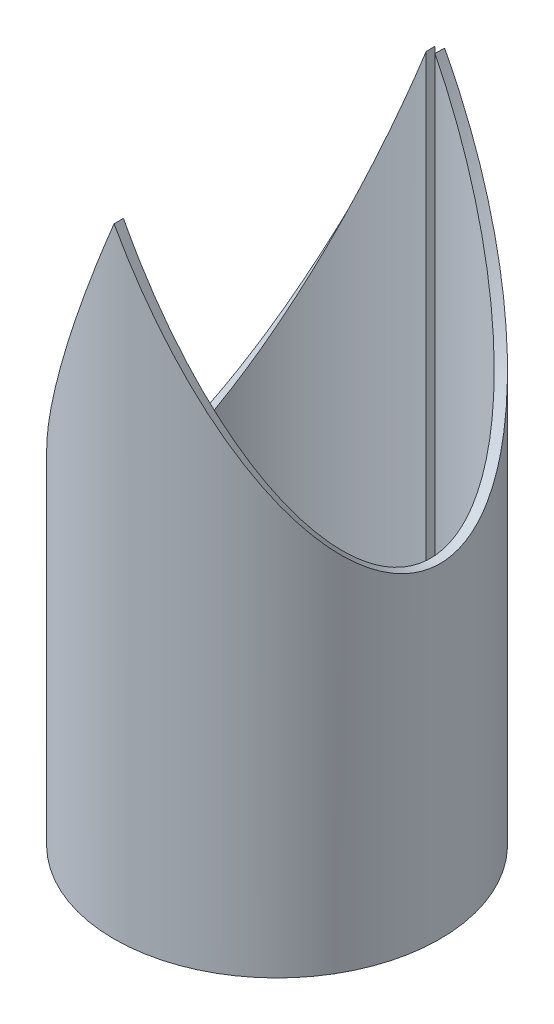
ISO-10303-21;
HEADER;
FILE_DESCRIPTION(('STEP AP214'),'2;1');
FILE_NAME('part.step','',(''),(''),'','','');
FILE_SCHEMA(('AUTOMOTIVE_DESIGN { 1 0 10303 214 1 1 1 1 }'));
ENDSEC;
DATA;
#1=APPLICATION_CONTEXT('core data for automotive mechanical design processes');
#2=APPLICATION_PROTOCOL_DEFINITION('international standard','automotive_design',2000,#1);
#3=PRODUCT_CONTEXT('',#1,'mechanical');
#4=PRODUCT('Part','Part','',(#3));
#5=PRODUCT_RELATED_PRODUCT_CATEGORY('part','',(#4));
#6=PRODUCT_DEFINITION_FORMATION('','',#4);
#7=PRODUCT_DEFINITION_CONTEXT('part definition',#1,'design');
#8=PRODUCT_DEFINITION('design','',#6,#7);
#9=PRODUCT_DEFINITION_SHAPE('','',#8);
#10=(LENGTH_UNIT() NAMED_UNIT(*) SI_UNIT(.MILLI.,.METRE.));
#11=(NAMED_UNIT(*) PLANE_ANGLE_UNIT() SI_UNIT($,.RADIAN.));
#12=(NAMED_UNIT(*) SI_UNIT($,.STERADIAN.) SOLID_ANGLE_UNIT());
#13=UNCERTAINTY_MEASURE_WITH_UNIT(LENGTH_MEASURE(1.E-05),#10,'distance_accuracy_value','');
#14=(GEOMETRIC_REPRESENTATION_CONTEXT(3) GLOBAL_UNCERTAINTY_ASSIGNED_CONTEXT((#13)) GLOBAL_UNIT_ASSIGNED_CONTEXT((#10,
#11,#12)) REPRESENTATION_CONTEXT('',''));
#15=CARTESIAN_POINT('',(0.,0.,0.));
#16=DIRECTION('',(0.,0.,1.));
#17=DIRECTION('',(1.,0.,0.));
#18=AXIS2_PLACEMENT_3D('',#15,#16,#17);
#19=CARTESIAN_POINT('',(-3.28657570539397E-13,-2.22044604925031E-13,17.3630786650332));
#20=CARTESIAN_POINT('',(-0.441148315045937,-1.0650221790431,17.3630786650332));
#21=CARTESIAN_POINT('',(-0.837154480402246,-2.02025341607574,17.3464387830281));
#22=CARTESIAN_POINT('',(-1.53769384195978,-3.71121377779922,17.29841795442));
#23=CARTESIAN_POINT('',(-1.8422641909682,-4.44692960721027,17.2670410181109));
#24=CARTESIAN_POINT('',(-2.1661662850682,-5.22936895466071,17.2275501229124));
#25=CARTESIAN_POINT('',(-2.22810868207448,-5.37899655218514,17.2196279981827));
#26=CARTESIAN_POINT('',(-2.31677710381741,-5.59314754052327,17.2078451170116));
#27=CARTESIAN_POINT('',(-2.3456257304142,-5.66281613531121,17.203934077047));
#28=CARTESIAN_POINT('',(-2.40191007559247,-5.7987231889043,17.196166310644));
#29=CARTESIAN_POINT('',(-2.42916140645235,-5.86451341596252,17.1923365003));
#30=CARTESIAN_POINT('',(-2.56550322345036,-6.1936677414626,17.1728516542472));
#31=CARTESIAN_POINT('',(-2.6731102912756,-6.45342447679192,17.1564140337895));
#32=CARTESIAN_POINT('',(-2.99150921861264,-7.22199450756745,17.1047833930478));
#33=CARTESIAN_POINT('',(-3.19787652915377,-7.72010762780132,17.0672745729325));
#34=CARTESIAN_POINT('',(-3.79918506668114,-9.17164628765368,16.9472650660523));
#35=CARTESIAN_POINT('',(-4.17630503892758,-10.0822711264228,16.8573148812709));
#36=CARTESIAN_POINT('',(-4.70655395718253,-11.3626069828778,16.7140172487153));
#37=CARTESIAN_POINT('',(-4.8764551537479,-11.772785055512,16.6651533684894));
#38=CARTESIAN_POINT('',(-5.21150314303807,-12.5815833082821,16.5634352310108));
#39=CARTESIAN_POINT('',(-5.37620612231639,-12.9791505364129,16.510665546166));
#40=CARTESIAN_POINT('',(-5.86180710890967,-14.1513565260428,16.3472441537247));
#41=CARTESIAN_POINT('',(-6.17418830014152,-14.9054995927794,16.2314864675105));
#42=CARTESIAN_POINT('',(-6.6257233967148,-15.9957228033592,16.0500032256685));
#43=CARTESIAN_POINT('',(-6.77339793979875,-16.3522986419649,15.9881994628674));
#44=CARTESIAN_POINT('',(-7.06309694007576,-17.051786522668,15.8623486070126));
#45=CARTESIAN_POINT('',(-7.20482123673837,-17.3939660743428,15.7984437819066));
#46=CARTESIAN_POINT('',(-7.90339844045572,-19.0804149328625,15.4723360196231));
#47=CARTESIAN_POINT('',(-8.43232246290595,-20.3570630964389,15.1891617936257));
#48=CARTESIAN_POINT('',(-9.18039767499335,-22.1632689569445,14.7404663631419));
#49=CARTESIAN_POINT('',(-9.42203817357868,-22.7467756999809,14.5870265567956));
#50=CARTESIAN_POINT('',(-9.89112661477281,-23.8793730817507,14.2731132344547));
#51=CARTESIAN_POINT('',(-10.1196286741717,-24.4309847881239,14.1119199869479));
#52=CARTESIAN_POINT('',(-10.7868753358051,-26.0417589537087,13.6171399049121));
#53=CARTESIAN_POINT('',(-11.2073294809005,-27.0568604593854,13.2723701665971));
#54=CARTESIAN_POINT('',(-11.8015116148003,-28.4913908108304,12.7385913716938));
#55=CARTESIAN_POINT('',(-11.9932928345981,-28.9543529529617,12.5581031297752));
#56=CARTESIAN_POINT('',(-12.3664220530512,-29.8550216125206,12.1908421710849));
#57=CARTESIAN_POINT('',(-12.5476330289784,-30.2924213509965,12.0041735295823));
#58=CARTESIAN_POINT('',(-13.075144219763,-31.5658167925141,11.4360923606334));
#59=CARTESIAN_POINT('',(-13.4053041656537,-32.3630087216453,11.0466145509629));
#60=CARTESIAN_POINT('',(-14.0227418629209,-33.8539158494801,10.2514673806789));
#61=CARTESIAN_POINT('',(-14.3096628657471,-34.5465440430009,9.84647013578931));
#62=CARTESIAN_POINT('',(-14.8451805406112,-35.8390235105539,9.01887133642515));
#63=CARTESIAN_POINT('',(-15.0932735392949,-36.4378163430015,8.5968138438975));
#64=CARTESIAN_POINT('',(-15.5499882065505,-37.5405082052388,7.74015382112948));
#65=CARTESIAN_POINT('',(-15.7586109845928,-38.0444072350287,7.3055523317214));
#66=CARTESIAN_POINT('',(-16.1366231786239,-38.9573114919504,6.42762066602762));
#67=CARTESIAN_POINT('',(-16.305993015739,-39.3660916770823,5.98450982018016));
#68=CARTESIAN_POINT('',(-16.7580087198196,-40.4572627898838,4.64098110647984));
#69=CARTESIAN_POINT('',(-16.983314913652,-41.0013376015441,3.72997580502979));
#70=CARTESIAN_POINT('',(-17.2850761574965,-41.7296850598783,1.88993311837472));
#71=CARTESIAN_POINT('',(-17.3611843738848,-41.9136052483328,0.961901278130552));
#72=CARTESIAN_POINT('',(-17.364903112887,-41.9225884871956,-0.892253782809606));
#73=CARTESIAN_POINT('',(-17.2923659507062,-41.7473806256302,-1.82156684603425));
#74=CARTESIAN_POINT('',(-16.9982624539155,-41.0374964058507,-3.66102437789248));
#75=CARTESIAN_POINT('',(-16.7765324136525,-40.5020014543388,-4.57327460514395));
#76=CARTESIAN_POINT('',(-16.3307243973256,-39.4258660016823,-5.91663217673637));
#77=CARTESIAN_POINT('',(-16.1632603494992,-39.0214391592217,-6.3603312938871));
#78=CARTESIAN_POINT('',(-15.7890102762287,-38.1175303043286,-7.23961005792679));
#79=CARTESIAN_POINT('',(-15.5823831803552,-37.6185555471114,-7.67468053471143));
#80=CARTESIAN_POINT('',(-15.1300123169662,-36.5265653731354,-8.53194668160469));
#81=CARTESIAN_POINT('',(-14.8842675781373,-35.9335499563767,-8.95414132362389));
#82=CARTESIAN_POINT('',(-14.3539114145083,-34.6534784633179,-9.78178384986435));
#83=CARTESIAN_POINT('',(-14.0689606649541,-33.9653860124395,-10.1879173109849));
#84=CARTESIAN_POINT('',(-13.455829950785,-32.484904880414,-10.9849876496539));
#85=CARTESIAN_POINT('',(-13.128094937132,-31.6936862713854,-11.3752030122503));
#86=CARTESIAN_POINT('',(-12.4302831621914,-30.0092929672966,-12.1338444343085));
#87=CARTESIAN_POINT('',(-12.0609042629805,-29.1176360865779,-12.5017539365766));
#88=CARTESIAN_POINT('',(-11.2732720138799,-27.2160089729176,-13.2163762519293));
#89=CARTESIAN_POINT('',(-10.8556159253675,-26.2077474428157,-13.5623182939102));
#90=CARTESIAN_POINT('',(-10.1934433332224,-24.6091831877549,-14.0586737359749));
#91=CARTESIAN_POINT('',(-9.96721224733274,-24.0629769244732,-14.2200790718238));
#92=CARTESIAN_POINT('',(-9.50033632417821,-22.9356687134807,-14.5361473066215));
#93=CARTESIAN_POINT('',(-9.25969341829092,-22.3546190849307,-14.690768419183));
#94=CARTESIAN_POINT('',(-8.76393726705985,-21.1577287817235,-14.9917978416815));
#95=CARTESIAN_POINT('',(-8.50882365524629,-20.5418881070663,-15.1382059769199));
#96=CARTESIAN_POINT('',(-8.11533376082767,-19.5920338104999,-15.350572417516));
#97=CARTESIAN_POINT('',(-7.98236807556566,-19.271066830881,-15.4201531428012));
#98=CARTESIAN_POINT('',(-7.71284834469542,-18.6204351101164,-15.5567121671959));
#99=CARTESIAN_POINT('',(-7.5765072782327,-18.2912776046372,-15.6235951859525));
#100=CARTESIAN_POINT('',(-6.88113025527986,-16.6123421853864,-15.953230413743));
#101=CARTESIAN_POINT('',(-6.2836329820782,-15.1698050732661,-16.2002678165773));
#102=CARTESIAN_POINT('',(-5.56504093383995,-13.4351384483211,-16.4473082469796));
#103=CARTESIAN_POINT('',(-5.48455530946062,-13.2408447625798,-16.474326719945));
#104=CARTESIAN_POINT('',(-5.32230416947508,-12.8491514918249,-16.5274579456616));
#105=CARTESIAN_POINT('',(-5.24070474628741,-12.6521528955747,-16.5535209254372));
#106=CARTESIAN_POINT('',(-4.99195519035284,-12.0515663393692,-16.630906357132));
#107=CARTESIAN_POINT('',(-4.82128944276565,-11.6394586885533,-16.6812725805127));
#108=CARTESIAN_POINT('',(-4.29470411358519,-10.367985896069,-16.8275001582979));
#109=CARTESIAN_POINT('',(-3.92417255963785,-9.47347091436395,-16.9185117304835));
#110=CARTESIAN_POINT('',(-3.33918227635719,-8.06139876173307,-17.0401299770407));
#111=CARTESIAN_POINT('',(-3.13932567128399,-7.57899143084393,-17.0781808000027));
#112=CARTESIAN_POINT('',(-2.88348007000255,-6.96133650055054,-17.1220541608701));
#113=CARTESIAN_POINT('',(-2.83193182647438,-6.83688185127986,-17.1306620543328));
#114=CARTESIAN_POINT('',(-2.72525861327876,-6.57929099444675,-17.1479557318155));
#115=CARTESIAN_POINT('',(-2.67050172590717,-6.44705002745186,-17.1565774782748));
#116=CARTESIAN_POINT('',(-2.5019590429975,-6.03999051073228,-17.1822472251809));
#117=CARTESIAN_POINT('',(-2.38390060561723,-5.75483534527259,-17.1991018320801));
#118=CARTESIAN_POINT('',(-1.76500789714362,-4.26014874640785,-17.2803533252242));
#119=CARTESIAN_POINT('',(-1.17803605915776,-2.84394232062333,-17.3363446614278));
#120=CARTESIAN_POINT('',(-0.499999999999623,-1.20710678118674,-17.3558779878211));
#121=CARTESIAN_POINT('',(-3.09722546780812E-13,-2.22044604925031E-13,16.3630786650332));
#122=CARTESIAN_POINT('',(-0.415740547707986,-1.06502088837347,16.3630786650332));
#123=CARTESIAN_POINT('',(-0.788939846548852,-2.02025341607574,16.3473971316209));
#124=CARTESIAN_POINT('',(-1.44913271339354,-3.71121377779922,16.3021419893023));
#125=CARTESIAN_POINT('',(-1.73616179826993,-4.44692960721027,16.2725721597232));
#126=CARTESIAN_POINT('',(-2.04140924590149,-5.22936895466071,16.2353556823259));
#127=CARTESIAN_POINT('',(-2.09978416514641,-5.37899655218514,16.2278898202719));
#128=CARTESIAN_POINT('',(-2.18334586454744,-5.59314754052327,16.2167855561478));
#129=CARTESIAN_POINT('',(-2.21053299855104,-5.66281613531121,16.2130997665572));
#130=CARTESIAN_POINT('',(-2.2635757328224,-5.7987231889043,16.2057793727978));
#131=CARTESIAN_POINT('',(-2.28925756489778,-5.86451341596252,16.202170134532));
#132=CARTESIAN_POINT('',(-2.41774698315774,-6.1936677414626,16.1838074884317));
#133=CARTESIAN_POINT('',(-2.51915658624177,-6.45342447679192,16.1683165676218));
#134=CARTESIAN_POINT('',(-2.81921781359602,-7.22199450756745,16.1196595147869));
#135=CARTESIAN_POINT('',(-3.01369971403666,-7.72010762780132,16.0843109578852));
#136=CARTESIAN_POINT('',(-3.58037680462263,-9.17164628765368,15.9712132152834));
#137=CARTESIAN_POINT('',(-3.93577712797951,-10.0822711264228,15.8864435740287));
#138=CARTESIAN_POINT('',(-4.43548716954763,-11.3626069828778,15.7513989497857));
#139=CARTESIAN_POINT('',(-4.59560316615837,-11.772785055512,15.7053493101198));
#140=CARTESIAN_POINT('',(-4.91135457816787,-12.5815833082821,15.6094894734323));
#141=CARTESIAN_POINT('',(-5.06657174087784,-12.9791505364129,15.5597589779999));
#142=CARTESIAN_POINT('',(-5.52420528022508,-14.1513565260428,15.4057495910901));
#143=CARTESIAN_POINT('',(-5.81859535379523,-14.9054995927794,15.2966587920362));
#144=CARTESIAN_POINT('',(-6.24412497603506,-15.9957228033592,15.1256278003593));
#145=CARTESIAN_POINT('',(-6.38329442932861,-16.3522986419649,15.0673835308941));
#146=CARTESIAN_POINT('',(-6.65630865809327,-17.051786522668,14.9487808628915));
#147=CARTESIAN_POINT('',(-6.7898705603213,-17.3939660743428,14.8885565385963));
#148=CARTESIAN_POINT('',(-7.44821427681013,-19.0804149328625,14.581230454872));
#149=CARTESIAN_POINT('',(-7.94667572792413,-20.3570630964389,14.3143652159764));
#150=CARTESIAN_POINT('',(-8.65166669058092,-22.1632689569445,13.8915117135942));
#151=CARTESIAN_POINT('',(-8.87939027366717,-22.7467756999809,13.7469090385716));
#152=CARTESIAN_POINT('',(-9.32146228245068,-23.8793730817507,13.4510750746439));
#153=CARTESIAN_POINT('',(-9.53680411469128,-24.4309847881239,13.2991655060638));
#154=CARTESIAN_POINT('',(-10.1656217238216,-26.0417589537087,12.8328815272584));
#155=CARTESIAN_POINT('',(-10.5618604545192,-27.0568604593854,12.5079682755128));
#156=CARTESIAN_POINT('',(-11.1218215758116,-28.4913908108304,12.0049316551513));
#157=CARTESIAN_POINT('',(-11.3025574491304,-28.9543529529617,11.8348383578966));
#158=CARTESIAN_POINT('',(-11.6541968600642,-29.8550216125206,11.4887292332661));
#159=CARTESIAN_POINT('',(-11.824971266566,-30.2924213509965,11.3128114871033));
#160=CARTESIAN_POINT('',(-12.3221012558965,-31.5658167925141,10.777448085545));
#161=CARTESIAN_POINT('',(-12.6332461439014,-32.3630087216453,10.4104016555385));
#162=CARTESIAN_POINT('',(-13.2151234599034,-33.8539158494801,9.66104977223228));
#163=CARTESIAN_POINT('',(-13.4855196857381,-34.5465440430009,9.27937772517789));
#164=CARTESIAN_POINT('',(-13.9901950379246,-35.8390235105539,8.49944321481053));
#165=CARTESIAN_POINT('',(-14.2239994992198,-36.4378163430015,8.10169347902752));
#166=CARTESIAN_POINT('',(-14.6544103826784,-37.5405082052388,7.29437148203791));
#167=CARTESIAN_POINT('',(-14.8510178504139,-38.0444072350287,6.88480020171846));
#168=CARTESIAN_POINT('',(-15.2072590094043,-38.9573114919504,6.05743166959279));
#169=CARTESIAN_POINT('',(-15.3668742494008,-39.3660916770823,5.63984111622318));
#170=CARTESIAN_POINT('',(-15.7928567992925,-40.4572627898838,4.37369088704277));
#171=CARTESIAN_POINT('',(-16.0051868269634,-41.0013376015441,3.51515354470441));
#172=CARTESIAN_POINT('',(-16.2895685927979,-41.7296850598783,1.78108530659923));
#173=CARTESIAN_POINT('',(-16.3612934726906,-41.9136052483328,0.90650204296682));
#174=CARTESIAN_POINT('',(-16.364798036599,-41.9225884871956,-0.840865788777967));
#175=CARTESIAN_POINT('',(-16.2964385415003,-41.7473806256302,-1.71665648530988));
#176=CARTESIAN_POINT('',(-16.0192734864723,-41.0374964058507,-3.45017326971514));
#177=CARTESIAN_POINT('',(-15.8103136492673,-40.5020014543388,-4.30988383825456));
#178=CARTESIAN_POINT('',(-15.390181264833,-39.4258660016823,-5.57587278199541));
#179=CARTESIAN_POINT('',(-15.2323620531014,-39.0214391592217,-5.99401772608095));
#180=CARTESIAN_POINT('',(-14.8796663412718,-38.1175303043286,-6.82265577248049));
#181=CARTESIAN_POINT('',(-14.6849396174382,-37.6185555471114,-7.23266902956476));
#182=CARTESIAN_POINT('',(-14.2586223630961,-36.5265653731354,-8.04056224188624));
#183=CARTESIAN_POINT('',(-14.0270309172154,-35.9335499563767,-8.43844122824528));
#184=CARTESIAN_POINT('',(-13.5272198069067,-34.6534784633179,-9.21841694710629));
#185=CARTESIAN_POINT('',(-13.2586803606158,-33.9653860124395,-9.60115977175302));
#186=CARTESIAN_POINT('',(-12.6808619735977,-32.484904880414,-10.352324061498));
#187=CARTESIAN_POINT('',(-12.3720023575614,-31.6936862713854,-10.7200655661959));
#188=CARTESIAN_POINT('',(-11.7143799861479,-30.0092929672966,-11.4350141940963));
#189=CARTESIAN_POINT('',(-11.3662749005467,-29.1176360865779,-11.7817345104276));
#190=CARTESIAN_POINT('',(-10.6240051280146,-27.2160089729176,-12.4551992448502));
#191=CARTESIAN_POINT('',(-10.2304033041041,-26.2077474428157,-12.7812172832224));
#192=CARTESIAN_POINT('',(-9.60636753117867,-24.6091831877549,-13.2489858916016));
#193=CARTESIAN_POINT('',(-9.39316587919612,-24.0629769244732,-13.4010953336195));
#194=CARTESIAN_POINT('',(-8.95317896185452,-22.9356687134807,-13.698960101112));
#195=CARTESIAN_POINT('',(-8.72639551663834,-22.3546190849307,-13.8446760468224));
#196=CARTESIAN_POINT('',(-8.25919168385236,-21.1577287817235,-14.1283681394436));
#197=CARTESIAN_POINT('',(-8.01877095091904,-20.5418881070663,-14.2663441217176));
#198=CARTESIAN_POINT('',(-7.64794350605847,-19.5920338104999,-14.4664796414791));
#199=CARTESIAN_POINT('',(-7.52263577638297,-19.271066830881,-14.5320529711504));
#200=CARTESIAN_POINT('',(-7.26863862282,-18.6204351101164,-14.6607470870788));
#201=CARTESIAN_POINT('',(-7.1401499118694,-18.2912776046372,-14.7237780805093));
#202=CARTESIAN_POINT('',(-6.48482206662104,-16.6123421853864,-15.0344284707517));
#203=CARTESIAN_POINT('',(-5.92173673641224,-15.1698050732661,-15.2672381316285));
#204=CARTESIAN_POINT('',(-5.24453089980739,-13.4351384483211,-15.5000506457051));
#205=CARTESIAN_POINT('',(-5.16868072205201,-13.2408447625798,-15.5255130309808));
#206=CARTESIAN_POINT('',(-5.01577418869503,-12.8491514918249,-15.5755842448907));
#207=CARTESIAN_POINT('',(-4.93887435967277,-12.6521528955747,-15.6001461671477));
#208=CARTESIAN_POINT('',(-4.70445115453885,-12.0515663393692,-15.6730747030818));
#209=CARTESIAN_POINT('',(-4.54361464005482,-11.6394586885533,-15.7205401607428));
#210=CARTESIAN_POINT('',(-4.04735718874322,-10.367985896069,-15.8583459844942));
#211=CARTESIAN_POINT('',(-3.69816583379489,-9.47347091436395,-15.9441158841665));
#212=CARTESIAN_POINT('',(-3.14686717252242,-8.06139876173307,-16.0587297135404));
#213=CARTESIAN_POINT('',(-2.958521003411,-7.57899143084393,-16.0945890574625));
#214=CARTESIAN_POINT('',(-2.71741043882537,-6.96133650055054,-16.1359355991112));
#215=CARTESIAN_POINT('',(-2.66883103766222,-6.83688185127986,-16.1440477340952));
#216=CARTESIAN_POINT('',(-2.56830150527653,-6.57929099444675,-16.1603454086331));
#217=CARTESIAN_POINT('',(-2.51669825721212,-6.44705002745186,-16.1684705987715));
#218=CARTESIAN_POINT('',(-2.35786253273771,-6.03999051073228,-16.1926619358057));
#219=CARTESIAN_POINT('',(-2.24660349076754,-5.75483534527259,-16.2085458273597));
#220=CARTESIAN_POINT('',(-1.66335496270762,-4.26014874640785,-16.285117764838));
#221=CARTESIAN_POINT('',(-1.1101866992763,-2.84393675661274,-16.3378844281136));
#222=CARTESIAN_POINT('',(-0.471203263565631,-1.20710678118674,-16.3562926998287));
#223=B_SPLINE_SURFACE_WITH_KNOTS('',1,3,((#19,#20,#21,#22,#23,#24,#25,#26,#27,#28,#29,#30,#31,
#32,#33,#34,#35,#36,#37,#38,#39,#40,#41,#42,#43,#44,#45,#46,#47,#48,#49,#50,#51,#52,#53,#54,#55,
#56,#57,#58,#59,#60,#61,#62,#63,#64,#65,#66,#67,#68,#69,#70,#71,#72,#73,#74,#75,#76,#77,#78,#79,
#80,#81,#82,#83,#84,#85,#86,#87,#88,#89,#90,#91,#92,#93,#94,#95,#96,#97,#98,#99,#100,#101,#102,
#103,#104,#105,#106,#107,#108,#109,#110,#111,#112,#113,#114,#115,#116,#117,#118,#119,#120),
(#121,#122,#123,#124,#125,#126,#127,#128,#129,#130,#131,#132,#133,#134,#135,#136,#137,#138,#139,
#140,#141,#142,#143,#144,#145,#146,#147,#148,#149,#150,#151,#152,#153,#154,#155,#156,#157,#158,
#159,#160,#161,#162,#163,#164,#165,#166,#167,#168,#169,#170,#171,#172,#173,#174,#175,#176,#177,
#178,#179,#180,#181,#182,#183,#184,#185,#186,#187,#188,#189,#190,#191,#192,#193,#194,#195,#196,
#197,#198,#199,#200,#201,#202,#203,#204,#205,#206,#207,#208,#209,#210,#211,#212,#213,#214,#215,
#216,#217,#218,#219,#220,#221,#222)),.UNSPECIFIED.,.F.,.F.,.F.,(2,2),(4,2,2,2,2,2,2,2,2,2,2,2,2,
2,2,2,2,2,2,2,2,2,2,2,2,2,2,2,2,2,2,2,2,2,2,2,2,2,2,2,2,2,2,2,2,2,2,2,2,2,4),(0.,1.),(0.,
0.0078125,0.015625,0.017578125,0.0185546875,0.01953125,0.0234375,0.03125,0.046875,0.0546875,
0.0625,0.078125,0.0859375,0.09375,0.125,0.140625,0.15625,0.1875,0.203125,0.21875,0.25,0.28125,
0.3125,0.34375,0.375,0.4375,0.5,0.5625,0.625,0.65625,0.6875,0.71875,0.75,0.78125,0.8125,0.84375,
0.859375,0.875,0.890625,0.8984375,0.90625,0.9375,0.94140625,0.9453125,0.953125,0.96875,
0.9765625,0.978515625,0.98046875,0.984375,1.),.UNSPECIFIED.);
#224=CARTESIAN_POINT('',(-3.09722546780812E-13,-2.22044604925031E-13,16.3630786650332));
#225=CARTESIAN_POINT('',(-3.28657570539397E-13,-2.22044604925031E-13,17.3630786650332));
#226=B_SPLINE_CURVE_WITH_KNOTS('',1,(#224,#225),.UNSPECIFIED.,.F.,.F.,(2,2),(0.,1.),.UNSPECIFIED.);
#227=CARTESIAN_POINT('',(-3.09722546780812E-13,-2.22044604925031E-13,16.3630786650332));
#228=VERTEX_POINT('',#227);
#229=CARTESIAN_POINT('',(-1.18524339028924E-07,-2.86141416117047E-07,17.3630786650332));
#230=VERTEX_POINT('',#229);
#231=EDGE_CURVE('E13',#228,#230,#226,.T.);
#232=CARTESIAN_POINT('',(-3.09722546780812E-13,-2.22044604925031E-13,16.3630786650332));
#233=CARTESIAN_POINT('',(-0.415740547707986,-1.06502088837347,16.3630786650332));
#234=CARTESIAN_POINT('',(-0.788939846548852,-2.02025341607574,16.3473971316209));
#235=CARTESIAN_POINT('',(-1.44913271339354,-3.71121377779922,16.3021419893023));
#236=CARTESIAN_POINT('',(-1.73616179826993,-4.44692960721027,16.2725721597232));
#237=CARTESIAN_POINT('',(-2.04140924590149,-5.22936895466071,16.2353556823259));
#238=CARTESIAN_POINT('',(-2.09978416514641,-5.37899655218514,16.2278898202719));
#239=CARTESIAN_POINT('',(-2.18334586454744,-5.59314754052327,16.2167855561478));
#240=CARTESIAN_POINT('',(-2.21053299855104,-5.66281613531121,16.2130997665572));
#241=CARTESIAN_POINT('',(-2.2635757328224,-5.7987231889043,16.2057793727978));
#242=CARTESIAN_POINT('',(-2.28925756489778,-5.86451341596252,16.202170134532));
#243=CARTESIAN_POINT('',(-2.41774698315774,-6.1936677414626,16.1838074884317));
#244=CARTESIAN_POINT('',(-2.51915658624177,-6.45342447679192,16.1683165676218));
#245=CARTESIAN_POINT('',(-2.81921781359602,-7.22199450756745,16.1196595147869));
#246=CARTESIAN_POINT('',(-3.01369971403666,-7.72010762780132,16.0843109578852));
#247=CARTESIAN_POINT('',(-3.58037680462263,-9.17164628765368,15.9712132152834));
#248=CARTESIAN_POINT('',(-3.93577712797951,-10.0822711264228,15.8864435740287));
#249=CARTESIAN_POINT('',(-4.43548716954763,-11.3626069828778,15.7513989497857));
#250=CARTESIAN_POINT('',(-4.59560316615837,-11.772785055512,15.7053493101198));
#251=CARTESIAN_POINT('',(-4.91135457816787,-12.5815833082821,15.6094894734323));
#252=CARTESIAN_POINT('',(-5.06657174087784,-12.9791505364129,15.5597589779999));
#253=CARTESIAN_POINT('',(-5.52420528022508,-14.1513565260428,15.4057495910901));
#254=CARTESIAN_POINT('',(-5.81859535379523,-14.9054995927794,15.2966587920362));
#255=CARTESIAN_POINT('',(-6.24412497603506,-15.9957228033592,15.1256278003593));
#256=CARTESIAN_POINT('',(-6.38329442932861,-16.3522986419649,15.0673835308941));
#257=CARTESIAN_POINT('',(-6.65630865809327,-17.051786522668,14.9487808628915));
#258=CARTESIAN_POINT('',(-6.7898705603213,-17.3939660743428,14.8885565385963));
#259=CARTESIAN_POINT('',(-7.44821427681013,-19.0804149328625,14.581230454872));
#260=CARTESIAN_POINT('',(-7.94667572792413,-20.3570630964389,14.3143652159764));
#261=CARTESIAN_POINT('',(-8.65166669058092,-22.1632689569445,13.8915117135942));
#262=CARTESIAN_POINT('',(-8.87939027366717,-22.7467756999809,13.7469090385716));
#263=CARTESIAN_POINT('',(-9.32146228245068,-23.8793730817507,13.4510750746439));
#264=CARTESIAN_POINT('',(-9.53680411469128,-24.4309847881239,13.2991655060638));
#265=CARTESIAN_POINT('',(-10.1656217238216,-26.0417589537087,12.8328815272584));
#266=CARTESIAN_POINT('',(-10.5618604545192,-27.0568604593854,12.5079682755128));
#267=CARTESIAN_POINT('',(-11.1218215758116,-28.4913908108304,12.0049316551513));
#268=CARTESIAN_POINT('',(-11.3025574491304,-28.9543529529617,11.8348383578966));
#269=CARTESIAN_POINT('',(-11.6541968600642,-29.8550216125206,11.4887292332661));
#270=CARTESIAN_POINT('',(-11.824971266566,-30.2924213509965,11.3128114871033));
#271=CARTESIAN_POINT('',(-12.3221012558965,-31.5658167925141,10.777448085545));
#272=CARTESIAN_POINT('',(-12.6332461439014,-32.3630087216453,10.4104016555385));
#273=CARTESIAN_POINT('',(-13.2151234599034,-33.8539158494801,9.66104977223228));
#274=CARTESIAN_POINT('',(-13.4855196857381,-34.5465440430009,9.27937772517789));
#275=CARTESIAN_POINT('',(-13.9901950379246,-35.8390235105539,8.49944321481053));
#276=CARTESIAN_POINT('',(-14.2239994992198,-36.4378163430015,8.10169347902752));
#277=CARTESIAN_POINT('',(-14.6544103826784,-37.5405082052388,7.29437148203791));
#278=CARTESIAN_POINT('',(-14.8510178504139,-38.0444072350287,6.88480020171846));
#279=CARTESIAN_POINT('',(-15.2072590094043,-38.9573114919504,6.05743166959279));
#280=CARTESIAN_POINT('',(-15.3668742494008,-39.3660916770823,5.63984111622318));
#281=CARTESIAN_POINT('',(-15.7928567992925,-40.4572627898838,4.37369088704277));
#282=CARTESIAN_POINT('',(-16.0051868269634,-41.0013376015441,3.51515354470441));
#283=CARTESIAN_POINT('',(-16.2895685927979,-41.7296850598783,1.78108530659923));
#284=CARTESIAN_POINT('',(-16.3612934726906,-41.9136052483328,0.90650204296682));
#285=CARTESIAN_POINT('',(-16.364798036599,-41.9225884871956,-0.840865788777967));
#286=CARTESIAN_POINT('',(-16.2964385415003,-41.7473806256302,-1.71665648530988));
#287=CARTESIAN_POINT('',(-16.0192734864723,-41.0374964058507,-3.45017326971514));
#288=CARTESIAN_POINT('',(-15.8103136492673,-40.5020014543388,-4.30988383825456));
#289=CARTESIAN_POINT('',(-15.390181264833,-39.4258660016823,-5.57587278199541));
#290=CARTESIAN_POINT('',(-15.2323620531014,-39.0214391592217,-5.99401772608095));
#291=CARTESIAN_POINT('',(-14.8796663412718,-38.1175303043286,-6.82265577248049));
#292=CARTESIAN_POINT('',(-14.6849396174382,-37.6185555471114,-7.23266902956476));
#293=CARTESIAN_POINT('',(-14.2586223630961,-36.5265653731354,-8.04056224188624));
#294=CARTESIAN_POINT('',(-14.0270309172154,-35.9335499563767,-8.43844122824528));
#295=CARTESIAN_POINT('',(-13.5272198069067,-34.6534784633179,-9.21841694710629));
#296=CARTESIAN_POINT('',(-13.2586803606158,-33.9653860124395,-9.60115977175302));
#297=CARTESIAN_POINT('',(-12.6808619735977,-32.484904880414,-10.352324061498));
#298=CARTESIAN_POINT('',(-12.3720023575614,-31.6936862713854,-10.7200655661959));
#299=CARTESIAN_POINT('',(-11.7143799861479,-30.0092929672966,-11.4350141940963));
#300=CARTESIAN_POINT('',(-11.3662749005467,-29.1176360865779,-11.7817345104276));
#301=CARTESIAN_POINT('',(-10.6240051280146,-27.2160089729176,-12.4551992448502));
#302=CARTESIAN_POINT('',(-10.2304033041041,-26.2077474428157,-12.7812172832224));
#303=CARTESIAN_POINT('',(-9.60636753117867,-24.6091831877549,-13.2489858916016));
#304=CARTESIAN_POINT('',(-9.39316587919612,-24.0629769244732,-13.4010953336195));
#305=CARTESIAN_POINT('',(-8.95317896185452,-22.9356687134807,-13.698960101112));
#306=CARTESIAN_POINT('',(-8.72639551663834,-22.3546190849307,-13.8446760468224));
#307=CARTESIAN_POINT('',(-8.25919168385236,-21.1577287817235,-14.1283681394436));
#308=CARTESIAN_POINT('',(-8.01877095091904,-20.5418881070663,-14.2663441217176));
#309=CARTESIAN_POINT('',(-7.64794350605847,-19.5920338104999,-14.4664796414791));
#310=CARTESIAN_POINT('',(-7.52263577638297,-19.271066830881,-14.5320529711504));
#311=CARTESIAN_POINT('',(-7.26863862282,-18.6204351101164,-14.6607470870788));
#312=CARTESIAN_POINT('',(-7.1401499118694,-18.2912776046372,-14.7237780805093));
#313=CARTESIAN_POINT('',(-6.48482206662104,-16.6123421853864,-15.0344284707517));
#314=CARTESIAN_POINT('',(-5.92173673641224,-15.1698050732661,-15.2672381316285));
#315=CARTESIAN_POINT('',(-5.24453089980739,-13.4351384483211,-15.5000506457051));
#316=CARTESIAN_POINT('',(-5.16868072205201,-13.2408447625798,-15.5255130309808));
#317=CARTESIAN_POINT('',(-5.01577418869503,-12.8491514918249,-15.5755842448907));
#318=CARTESIAN_POINT('',(-4.93887435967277,-12.6521528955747,-15.6001461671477));
#319=CARTESIAN_POINT('',(-4.70445115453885,-12.0515663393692,-15.6730747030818));
#320=CARTESIAN_POINT('',(-4.54361464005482,-11.6394586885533,-15.7205401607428));
#321=CARTESIAN_POINT('',(-4.04735718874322,-10.367985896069,-15.8583459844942));
#322=CARTESIAN_POINT('',(-3.69816583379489,-9.47347091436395,-15.9441158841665));
#323=CARTESIAN_POINT('',(-3.14686717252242,-8.06139876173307,-16.0587297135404));
#324=CARTESIAN_POINT('',(-2.958521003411,-7.57899143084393,-16.0945890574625));
#325=CARTESIAN_POINT('',(-2.71741043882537,-6.96133650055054,-16.1359355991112));
#326=CARTESIAN_POINT('',(-2.66883103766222,-6.83688185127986,-16.1440477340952));
#327=CARTESIAN_POINT('',(-2.56830150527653,-6.57929099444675,-16.1603454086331));
#328=CARTESIAN_POINT('',(-2.51669825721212,-6.44705002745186,-16.1684705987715));
#329=CARTESIAN_POINT('',(-2.35786253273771,-6.03999051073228,-16.1926619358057));
#330=CARTESIAN_POINT('',(-2.24660349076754,-5.75483534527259,-16.2085458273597));
#331=CARTESIAN_POINT('',(-1.66335496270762,-4.26014874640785,-16.285117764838));
#332=CARTESIAN_POINT('',(-1.1101866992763,-2.84393675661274,-16.3378844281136));
#333=CARTESIAN_POINT('',(-0.471203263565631,-1.20710678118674,-16.3562926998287));
#334=B_SPLINE_CURVE_WITH_KNOTS('',3,(#232,#233,#234,#235,#236,#237,#238,#239,#240,#241,#242,
#243,#244,#245,#246,#247,#248,#249,#250,#251,#252,#253,#254,#255,#256,#257,#258,#259,#260,#261,
#262,#263,#264,#265,#266,#267,#268,#269,#270,#271,#272,#273,#274,#275,#276,#277,#278,#279,#280,
#281,#282,#283,#284,#285,#286,#287,#288,#289,#290,#291,#292,#293,#294,#295,#296,#297,#298,#299,
#300,#301,#302,#303,#304,#305,#306,#307,#308,#309,#310,#311,#312,#313,#314,#315,#316,#317,#318,
#319,#320,#321,#322,#323,#324,#325,#326,#327,#328,#329,#330,#331,#332,#333),.UNSPECIFIED.,.F.,
.F.,(4,2,2,2,2,2,2,2,2,2,2,2,2,2,2,2,2,2,2,2,2,2,2,2,2,2,2,2,2,2,2,2,2,2,2,2,2,2,2,2,2,2,2,2,2,
2,2,2,2,2,4),(0.,0.0078125,0.015625,0.017578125,0.0185546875,0.01953125,0.0234375,0.03125,
0.046875,0.0546875,0.0625,0.078125,0.0859375,0.09375,0.125,0.140625,0.15625,0.1875,0.203125,
0.21875,0.25,0.28125,0.3125,0.34375,0.375,0.4375,0.5,0.5625,0.625,0.65625,0.6875,0.71875,0.75,
0.78125,0.8125,0.84375,0.859375,0.875,0.890625,0.8984375,0.90625,0.9375,0.94140625,0.9453125,
0.953125,0.96875,0.9765625,0.978515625,0.98046875,0.984375,1.),.UNSPECIFIED.);
#335=CARTESIAN_POINT('',(-0.471203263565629,-1.20710678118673,-16.3562926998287));
#336=VERTEX_POINT('',#335);
#337=EDGE_CURVE('E101',#228,#336,#334,.T.);
#338=CARTESIAN_POINT('',(-0.471203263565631,-1.20710678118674,-16.3562926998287));
#339=CARTESIAN_POINT('',(-0.499999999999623,-1.20710678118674,-17.3558779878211));
#340=B_SPLINE_CURVE_WITH_KNOTS('',1,(#338,#339),.UNSPECIFIED.,.F.,.F.,(2,2),(0.,1.),.UNSPECIFIED.);
#341=CARTESIAN_POINT('',(-0.499999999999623,-1.20710678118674,-17.3558779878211));
#342=VERTEX_POINT('',#341);
#343=EDGE_CURVE('E52',#336,#342,#340,.T.);
#344=CARTESIAN_POINT('',(-0.499999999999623,-1.20710678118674,-17.3558779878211));
#345=CARTESIAN_POINT('',(-1.17803605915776,-2.84394232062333,-17.3363446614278));
#346=CARTESIAN_POINT('',(-1.76500789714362,-4.26014874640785,-17.2803533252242));
#347=CARTESIAN_POINT('',(-2.38390060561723,-5.75483534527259,-17.1991018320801));
#348=CARTESIAN_POINT('',(-2.5019590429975,-6.03999051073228,-17.1822472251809));
#349=CARTESIAN_POINT('',(-2.67050172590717,-6.44705002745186,-17.1565774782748));
#350=CARTESIAN_POINT('',(-2.72525861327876,-6.57929099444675,-17.1479557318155));
#351=CARTESIAN_POINT('',(-2.83193182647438,-6.83688185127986,-17.1306620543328));
#352=CARTESIAN_POINT('',(-2.88348007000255,-6.96133650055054,-17.1220541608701));
#353=CARTESIAN_POINT('',(-3.13932567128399,-7.57899143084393,-17.0781808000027));
#354=CARTESIAN_POINT('',(-3.33918227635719,-8.06139876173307,-17.0401299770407));
#355=CARTESIAN_POINT('',(-3.92417255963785,-9.47347091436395,-16.9185117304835));
#356=CARTESIAN_POINT('',(-4.29470411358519,-10.367985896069,-16.8275001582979));
#357=CARTESIAN_POINT('',(-4.82128944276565,-11.6394586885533,-16.6812725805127));
#358=CARTESIAN_POINT('',(-4.99195519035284,-12.0515663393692,-16.630906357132));
#359=CARTESIAN_POINT('',(-5.24070474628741,-12.6521528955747,-16.5535209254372));
#360=CARTESIAN_POINT('',(-5.32230416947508,-12.8491514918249,-16.5274579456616));
#361=CARTESIAN_POINT('',(-5.48455530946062,-13.2408447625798,-16.474326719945));
#362=CARTESIAN_POINT('',(-5.56504093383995,-13.4351384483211,-16.4473082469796));
#363=CARTESIAN_POINT('',(-6.2836329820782,-15.1698050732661,-16.2002678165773));
#364=CARTESIAN_POINT('',(-6.88113025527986,-16.6123421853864,-15.953230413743));
#365=CARTESIAN_POINT('',(-7.5765072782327,-18.2912776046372,-15.6235951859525));
#366=CARTESIAN_POINT('',(-7.71284834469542,-18.6204351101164,-15.5567121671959));
#367=CARTESIAN_POINT('',(-7.98236807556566,-19.271066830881,-15.4201531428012));
#368=CARTESIAN_POINT('',(-8.11533376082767,-19.5920338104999,-15.350572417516));
#369=CARTESIAN_POINT('',(-8.50882365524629,-20.5418881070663,-15.1382059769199));
#370=CARTESIAN_POINT('',(-8.76393726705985,-21.1577287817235,-14.9917978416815));
#371=CARTESIAN_POINT('',(-9.25969341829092,-22.3546190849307,-14.690768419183));
#372=CARTESIAN_POINT('',(-9.50033632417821,-22.9356687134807,-14.5361473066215));
#373=CARTESIAN_POINT('',(-9.96721224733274,-24.0629769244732,-14.2200790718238));
#374=CARTESIAN_POINT('',(-10.1934433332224,-24.6091831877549,-14.0586737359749));
#375=CARTESIAN_POINT('',(-10.8556159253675,-26.2077474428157,-13.5623182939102));
#376=CARTESIAN_POINT('',(-11.2732720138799,-27.2160089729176,-13.2163762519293));
#377=CARTESIAN_POINT('',(-12.0609042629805,-29.1176360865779,-12.5017539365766));
#378=CARTESIAN_POINT('',(-12.4302831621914,-30.0092929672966,-12.1338444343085));
#379=CARTESIAN_POINT('',(-13.128094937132,-31.6936862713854,-11.3752030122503));
#380=CARTESIAN_POINT('',(-13.455829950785,-32.484904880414,-10.9849876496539));
#381=CARTESIAN_POINT('',(-14.0689606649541,-33.9653860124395,-10.1879173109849));
#382=CARTESIAN_POINT('',(-14.3539114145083,-34.6534784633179,-9.78178384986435));
#383=CARTESIAN_POINT('',(-14.8842675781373,-35.9335499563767,-8.95414132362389));
#384=CARTESIAN_POINT('',(-15.1300123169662,-36.5265653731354,-8.53194668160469));
#385=CARTESIAN_POINT('',(-15.5823831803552,-37.6185555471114,-7.67468053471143));
#386=CARTESIAN_POINT('',(-15.7890102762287,-38.1175303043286,-7.23961005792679));
#387=CARTESIAN_POINT('',(-16.1632603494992,-39.0214391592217,-6.3603312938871));
#388=CARTESIAN_POINT('',(-16.3307243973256,-39.4258660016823,-5.91663217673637));
#389=CARTESIAN_POINT('',(-16.7765324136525,-40.5020014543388,-4.57327460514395));
#390=CARTESIAN_POINT('',(-16.9982624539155,-41.0374964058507,-3.66102437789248));
#391=CARTESIAN_POINT('',(-17.2923659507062,-41.7473806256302,-1.82156684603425));
#392=CARTESIAN_POINT('',(-17.364903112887,-41.9225884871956,-0.892253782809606));
#393=CARTESIAN_POINT('',(-17.3611843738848,-41.9136052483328,0.961901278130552));
#394=CARTESIAN_POINT('',(-17.2850761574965,-41.7296850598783,1.88993311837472));
#395=CARTESIAN_POINT('',(-16.983314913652,-41.0013376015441,3.72997580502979));
#396=CARTESIAN_POINT('',(-16.7580087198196,-40.4572627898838,4.64098110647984));
#397=CARTESIAN_POINT('',(-16.305993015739,-39.3660916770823,5.98450982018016));
#398=CARTESIAN_POINT('',(-16.1366231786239,-38.9573114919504,6.42762066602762));
#399=CARTESIAN_POINT('',(-15.7586109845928,-38.0444072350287,7.3055523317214));
#400=CARTESIAN_POINT('',(-15.5499882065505,-37.5405082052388,7.74015382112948));
#401=CARTESIAN_POINT('',(-15.0932735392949,-36.4378163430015,8.5968138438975));
#402=CARTESIAN_POINT('',(-14.8451805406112,-35.8390235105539,9.01887133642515));
#403=CARTESIAN_POINT('',(-14.3096628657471,-34.5465440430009,9.84647013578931));
#404=CARTESIAN_POINT('',(-14.0227418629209,-33.8539158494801,10.2514673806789));
#405=CARTESIAN_POINT('',(-13.4053041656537,-32.3630087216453,11.0466145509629));
#406=CARTESIAN_POINT('',(-13.075144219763,-31.5658167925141,11.4360923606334));
#407=CARTESIAN_POINT('',(-12.5476330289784,-30.2924213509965,12.0041735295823));
#408=CARTESIAN_POINT('',(-12.3664220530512,-29.8550216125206,12.1908421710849));
#409=CARTESIAN_POINT('',(-11.9932928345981,-28.9543529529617,12.5581031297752));
#410=CARTESIAN_POINT('',(-11.8015116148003,-28.4913908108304,12.7385913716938));
#411=CARTESIAN_POINT('',(-11.2073294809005,-27.0568604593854,13.2723701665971));
#412=CARTESIAN_POINT('',(-10.7868753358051,-26.0417589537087,13.6171399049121));
#413=CARTESIAN_POINT('',(-10.1196286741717,-24.4309847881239,14.1119199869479));
#414=CARTESIAN_POINT('',(-9.89112661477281,-23.8793730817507,14.2731132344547));
#415=CARTESIAN_POINT('',(-9.42203817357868,-22.7467756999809,14.5870265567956));
#416=CARTESIAN_POINT('',(-9.18039767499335,-22.1632689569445,14.7404663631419));
#417=CARTESIAN_POINT('',(-8.43232246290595,-20.3570630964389,15.1891617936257));
#418=CARTESIAN_POINT('',(-7.90339844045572,-19.0804149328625,15.4723360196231));
#419=CARTESIAN_POINT('',(-7.20482123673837,-17.3939660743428,15.7984437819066));
#420=CARTESIAN_POINT('',(-7.06309694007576,-17.051786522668,15.8623486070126));
#421=CARTESIAN_POINT('',(-6.77339793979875,-16.3522986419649,15.9881994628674));
#422=CARTESIAN_POINT('',(-6.6257233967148,-15.9957228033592,16.0500032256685));
#423=CARTESIAN_POINT('',(-6.17418830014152,-14.9054995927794,16.2314864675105));
#424=CARTESIAN_POINT('',(-5.86180710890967,-14.1513565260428,16.3472441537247));
#425=CARTESIAN_POINT('',(-5.37620612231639,-12.9791505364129,16.510665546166));
#426=CARTESIAN_POINT('',(-5.21150314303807,-12.5815833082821,16.5634352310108));
#427=CARTESIAN_POINT('',(-4.8764551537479,-11.772785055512,16.6651533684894));
#428=CARTESIAN_POINT('',(-4.70655395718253,-11.3626069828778,16.7140172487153));
#429=CARTESIAN_POINT('',(-4.17630503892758,-10.0822711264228,16.8573148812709));
#430=CARTESIAN_POINT('',(-3.79918506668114,-9.17164628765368,16.9472650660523));
#431=CARTESIAN_POINT('',(-3.19787652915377,-7.72010762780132,17.0672745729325));
#432=CARTESIAN_POINT('',(-2.99150921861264,-7.22199450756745,17.1047833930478));
#433=CARTESIAN_POINT('',(-2.6731102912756,-6.45342447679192,17.1564140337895));
#434=CARTESIAN_POINT('',(-2.56550322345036,-6.1936677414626,17.1728516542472));
#435=CARTESIAN_POINT('',(-2.42916140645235,-5.86451341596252,17.1923365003));
#436=CARTESIAN_POINT('',(-2.40191007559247,-5.7987231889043,17.196166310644));
#437=CARTESIAN_POINT('',(-2.3456257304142,-5.66281613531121,17.203934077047));
#438=CARTESIAN_POINT('',(-2.31677710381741,-5.59314754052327,17.2078451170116));
#439=CARTESIAN_POINT('',(-2.22810868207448,-5.37899655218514,17.2196279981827));
#440=CARTESIAN_POINT('',(-2.1661662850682,-5.22936895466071,17.2275501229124));
#441=CARTESIAN_POINT('',(-1.8422641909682,-4.44692960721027,17.2670410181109));
#442=CARTESIAN_POINT('',(-1.53769384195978,-3.71121377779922,17.29841795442));
#443=CARTESIAN_POINT('',(-0.837154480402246,-2.02025341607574,17.3464387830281));
#444=CARTESIAN_POINT('',(-0.441148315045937,-1.0650221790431,17.3630786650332));
#445=CARTESIAN_POINT('',(-3.28657570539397E-13,-2.22044604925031E-13,17.3630786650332));
#446=B_SPLINE_CURVE_WITH_KNOTS('',3,(#344,#345,#346,#347,#348,#349,#350,#351,#352,#353,#354,
#355,#356,#357,#358,#359,#360,#361,#362,#363,#364,#365,#366,#367,#368,#369,#370,#371,#372,#373,
#374,#375,#376,#377,#378,#379,#380,#381,#382,#383,#384,#385,#386,#387,#388,#389,#390,#391,#392,
#393,#394,#395,#396,#397,#398,#399,#400,#401,#402,#403,#404,#405,#406,#407,#408,#409,#410,#411,
#412,#413,#414,#415,#416,#417,#418,#419,#420,#421,#422,#423,#424,#425,#426,#427,#428,#429,#430,
#431,#432,#433,#434,#435,#436,#437,#438,#439,#440,#441,#442,#443,#444,#445),.UNSPECIFIED.,.F.,
.F.,(4,2,2,2,2,2,2,2,2,2,2,2,2,2,2,2,2,2,2,2,2,2,2,2,2,2,2,2,2,2,2,2,2,2,2,2,2,2,2,2,2,2,2,2,2,
2,2,2,2,2,4),(0.,0.015625,0.01953125,0.021484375,0.0234375,0.03125,0.046875,0.0546875,
0.05859375,0.0625,0.09375,0.1015625,0.109375,0.125,0.140625,0.15625,0.1875,0.21875,0.25,0.28125,
0.3125,0.34375,0.375,0.4375,0.5,0.5625,0.625,0.65625,0.6875,0.71875,0.75,0.78125,0.796875,
0.8125,0.84375,0.859375,0.875,0.90625,0.9140625,0.921875,0.9375,0.9453125,0.953125,0.96875,
0.9765625,0.98046875,0.9814453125,0.982421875,0.984375,0.9921875,1.),.UNSPECIFIED.);
#447=EDGE_CURVE('E99',#230,#342,#446,.F.);
#448=ORIENTED_EDGE('',*,*,#231,.F.);
#449=ORIENTED_EDGE('',*,*,#337,.T.);
#450=ORIENTED_EDGE('',*,*,#343,.T.);
#451=ORIENTED_EDGE('',*,*,#447,.F.);
#452=EDGE_LOOP('',(#448,#449,#450,#451));
#453=FACE_BOUND('',#452,.T.);
#454=ADVANCED_FACE('F38',(#453),#223,.T.);
#455=CARTESIAN_POINT('',(-0.471203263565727,-33.6035533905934,-16.3562926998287));
#456=DIRECTION('',(0.999585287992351,0.,-0.0287967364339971));
#457=DIRECTION('',(0.,-1.,0.));
#458=AXIS2_PLACEMENT_3D('',#455,#456,#457);
#459=PLANE('',#458);
#460=ORIENTED_EDGE('',*,*,#343,.F.);
#461=DIRECTION('',(0.,-1.,0.));
#462=VECTOR('',#461,1.);
#463=CARTESIAN_POINT('',(-0.471203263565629,-1.20710678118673,-16.3562926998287));
#464=LINE('',#463,#462);
#465=CARTESIAN_POINT('',(-0.471203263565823,-66.,-16.3562926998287));
#466=VERTEX_POINT('',#465);
#467=EDGE_CURVE('E313',#336,#466,#464,.T.);
#468=ORIENTED_EDGE('',*,*,#467,.T.);
#469=DIRECTION('',(-0.0287967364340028,0.,-0.999585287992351));
#470=VECTOR('',#469,1.);
#471=CARTESIAN_POINT('',(-0.471203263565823,-66.,-16.3562926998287));
#472=LINE('',#471,#470);
#473=CARTESIAN_POINT('',(-0.499999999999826,-66.,-17.3558779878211));
#474=VERTEX_POINT('',#473);
#475=EDGE_CURVE('E92',#466,#474,#472,.T.);
#476=ORIENTED_EDGE('',*,*,#475,.T.);
#477=DIRECTION('',(0.,1.,0.));
#478=VECTOR('',#477,1.);
#479=CARTESIAN_POINT('',(-0.499999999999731,-187.433804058,-17.3558779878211));
#480=LINE('',#479,#478);
#481=EDGE_CURVE('E113',#342,#474,#480,.F.);
#482=ORIENTED_EDGE('',*,*,#481,.F.);
#483=EDGE_LOOP('',(#460,#468,#476,#482));
#484=FACE_BOUND('',#483,.T.);
#485=ADVANCED_FACE('F120',(#484),#459,.T.);
#486=CARTESIAN_POINT('',(0.,-66.,0.));
#487=DIRECTION('',(0.,-1.,0.));
#488=DIRECTION('',(1.,0.,0.));
#489=AXIS2_PLACEMENT_3D('',#486,#487,#488);
#490=PLANE('',#489);
#491=ORIENTED_EDGE('',*,*,#475,.F.);
#492=CARTESIAN_POINT('',(0.,-66.,0.));
#493=DIRECTION('',(0.,1.,0.));
#494=DIRECTION('',(-1.,0.,0.));
#495=AXIS2_PLACEMENT_3D('',#492,#493,#494);
#496=CIRCLE('',#495,16.3630786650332);
#497=CARTESIAN_POINT('',(0.471203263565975,-66.,-16.3562926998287));
#498=VERTEX_POINT('',#497);
#499=EDGE_CURVE('E200',#466,#498,#496,.T.);
#500=ORIENTED_EDGE('',*,*,#499,.T.);
#501=DIRECTION('',(0.0287967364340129,0.,-0.99958528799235));
#502=VECTOR('',#501,1.);
#503=CARTESIAN_POINT('',(0.471203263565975,-66.,-16.3562926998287));
#504=LINE('',#503,#502);
#505=CARTESIAN_POINT('',(0.499999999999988,-66.,-17.3558779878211));
#506=VERTEX_POINT('',#505);
#507=EDGE_CURVE('E190',#498,#506,#504,.T.);
#508=ORIENTED_EDGE('',*,*,#507,.T.);
#509=CARTESIAN_POINT('',(0.,-66.,0.));
#510=DIRECTION('',(0.,1.,0.));
#511=DIRECTION('',(-1.,0.,0.));
#512=AXIS2_PLACEMENT_3D('',#509,#510,#511);
#513=CIRCLE('',#512,17.3630786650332);
#514=EDGE_CURVE('E121',#474,#506,#513,.T.);
#515=ORIENTED_EDGE('',*,*,#514,.F.);
#516=EDGE_LOOP('',(#491,#500,#508,#515));
#517=FACE_BOUND('',#516,.T.);
#518=ADVANCED_FACE('F198',(#517),#490,.T.);
#519=CARTESIAN_POINT('',(0.471203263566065,-33.4516081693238,-16.3562926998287));
#520=DIRECTION('',(0.99958528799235,0.,0.0287967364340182));
#521=DIRECTION('',(0.,-1.,0.));
#522=AXIS2_PLACEMENT_3D('',#519,#520,#521);
#523=PLANE('',#522);
#524=ORIENTED_EDGE('',*,*,#507,.F.);
#525=DIRECTION('',(0.,-1.,0.));
#526=VECTOR('',#525,1.);
#527=CARTESIAN_POINT('',(0.471203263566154,-0.90321633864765,-16.3562926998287));
#528=LINE('',#527,#526);
#529=CARTESIAN_POINT('',(0.471203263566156,-0.90321633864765,-16.3562926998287));
#530=VERTEX_POINT('',#529);
#531=EDGE_CURVE('E123',#530,#498,#528,.T.);
#532=ORIENTED_EDGE('',*,*,#531,.F.);
#533=CARTESIAN_POINT('',(0.50000000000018,-0.90321633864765,-17.3558779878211));
#534=CARTESIAN_POINT('',(0.471203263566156,-0.90321633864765,-16.3562926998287));
#535=B_SPLINE_CURVE_WITH_KNOTS('',1,(#533,#534),.UNSPECIFIED.,.F.,.F.,(2,2),(0.,1.),.UNSPECIFIED.);
#536=CARTESIAN_POINT('',(0.500000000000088,-0.90321633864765,-17.3558779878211));
#537=VERTEX_POINT('',#536);
#538=EDGE_CURVE('E60',#530,#537,#535,.F.);
#539=ORIENTED_EDGE('',*,*,#538,.T.);
#540=DIRECTION('',(0.,1.,0.));
#541=VECTOR('',#540,1.);
#542=CARTESIAN_POINT('',(0.500000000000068,-187.433804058,-17.3558779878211));
#543=LINE('',#542,#541);
#544=EDGE_CURVE('E158',#537,#506,#543,.F.);
#545=ORIENTED_EDGE('',*,*,#544,.T.);
#546=EDGE_LOOP('',(#524,#532,#539,#545));
#547=FACE_BOUND('',#546,.T.);
#548=ADVANCED_FACE('F141',(#547),#523,.F.);
#549=CARTESIAN_POINT('',(0.50000000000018,-0.90321633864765,-17.3558779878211));
#550=CARTESIAN_POINT('',(1.15654621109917,-2.08915247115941,-17.3369637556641));
#551=CARTESIAN_POINT('',(1.7334208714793,-3.13040395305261,-17.2835806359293));
#552=CARTESIAN_POINT('',(2.47781611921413,-4.47551732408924,-17.1871908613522));
#553=CARTESIAN_POINT('',(2.70585655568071,-4.88774652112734,-17.1522420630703));
#554=CARTESIAN_POINT('',(3.01802784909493,-5.4518774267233,-17.0990979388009));
#555=CARTESIAN_POINT('',(3.11650280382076,-5.629781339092,-17.0813929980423));
#556=CARTESIAN_POINT('',(3.31378706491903,-5.98616993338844,-17.0442187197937));
#557=CARTESIAN_POINT('',(3.41137980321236,-6.1624516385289,-17.0249436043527));
#558=CARTESIAN_POINT('',(3.89406956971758,-7.03429720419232,-16.9253709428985));
#559=CARTESIAN_POINT('',(4.2633190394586,-7.70117218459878,-16.8355012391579));
#560=CARTESIAN_POINT('',(4.79164634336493,-8.65558244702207,-16.6898172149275));
#561=CARTESIAN_POINT('',(4.96350281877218,-8.96606883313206,-16.6394388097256));
#562=CARTESIAN_POINT('',(5.29873436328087,-9.57174086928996,-16.5357400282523));
#563=CARTESIAN_POINT('',(5.46178730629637,-9.86634451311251,-16.4825305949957));
#564=CARTESIAN_POINT('',(6.25950712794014,-11.307466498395,-16.2095658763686));
#565=CARTESIAN_POINT('',(6.85956370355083,-12.3911616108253,-15.9627284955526));
#566=CARTESIAN_POINT('',(7.56149739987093,-13.6592774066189,-15.6308787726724));
#567=CARTESIAN_POINT('',(7.69948568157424,-13.9085754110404,-15.5633386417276));
#568=CARTESIAN_POINT('',(7.97068479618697,-14.3985211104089,-15.4262041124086));
#569=CARTESIAN_POINT('',(8.10369597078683,-14.6388019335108,-15.3567210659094));
#570=CARTESIAN_POINT('',(8.49782873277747,-15.3507323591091,-15.144387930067));
#571=CARTESIAN_POINT('',(8.75364310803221,-15.8127659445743,-14.9978301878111));
#572=CARTESIAN_POINT('',(9.50011825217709,-17.1611066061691,-14.5452041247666));
#573=CARTESIAN_POINT('',(9.96976622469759,-18.0096535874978,-14.2262117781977));
#574=CARTESIAN_POINT('',(10.6325363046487,-19.206953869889,-13.7295987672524));
#575=CARTESIAN_POINT('',(10.8470643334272,-19.5944388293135,-13.5606470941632));
#576=CARTESIAN_POINT('',(11.2650175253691,-20.3493878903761,-13.2154959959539));
#577=CARTESIAN_POINT('',(11.4681749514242,-20.7163645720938,-13.0394954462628));
#578=CARTESIAN_POINT('',(12.0601627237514,-21.7858010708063,-12.5025151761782));
#579=CARTESIAN_POINT('',(12.4314842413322,-22.4567673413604,-12.1325723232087));
#580=CARTESIAN_POINT('',(13.1279362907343,-23.7147170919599,-11.3753417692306));
#581=CARTESIAN_POINT('',(13.4548651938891,-24.3050936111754,-10.9861593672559));
#582=CARTESIAN_POINT('',(14.0678107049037,-25.4123556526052,-10.1894944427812));
#583=CARTESIAN_POINT('',(14.3535203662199,-25.9286473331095,-9.78234689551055));
#584=CARTESIAN_POINT('',(14.8836882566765,-26.8865520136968,-8.95509249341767));
#585=CARTESIAN_POINT('',(15.1278585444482,-27.3274439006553,-8.53566169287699));
#586=CARTESIAN_POINT('',(15.8043155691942,-28.5487001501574,-7.25483327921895));
#587=CARTESIAN_POINT('',(16.1786551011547,-29.2248584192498,-6.37320588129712));
#588=CARTESIAN_POINT('',(16.625141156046,-30.032076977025,-5.0302798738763));
#589=CARTESIAN_POINT('',(16.7547152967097,-30.2663876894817,-4.57984661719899));
#590=CARTESIAN_POINT('',(16.977076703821,-30.6679329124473,-3.67074192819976));
#591=CARTESIAN_POINT('',(17.0697086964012,-30.8350387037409,-3.21235861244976));
#592=CARTESIAN_POINT('',(17.2915396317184,-31.2353556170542,-1.83029132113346));
#593=CARTESIAN_POINT('',(17.364551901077,-31.3675662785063,-0.899708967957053));
#594=CARTESIAN_POINT('',(17.3623081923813,-31.3638813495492,0.491848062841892));
#595=CARTESIAN_POINT('',(17.3430331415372,-31.328997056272,0.954867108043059));
#596=CARTESIAN_POINT('',(17.267101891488,-31.1914595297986,1.88142552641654));
#597=CARTESIAN_POINT('',(17.2104261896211,-31.0888602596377,2.34435219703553));
#598=CARTESIAN_POINT('',(16.9839766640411,-30.6795709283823,3.72747393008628));
#599=CARTESIAN_POINT('',(16.7576480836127,-30.271389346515,4.64202380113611));
#600=CARTESIAN_POINT('',(16.1557910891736,-29.1843821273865,6.43098503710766));
#601=CARTESIAN_POINT('',(15.7778400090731,-28.5011146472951,7.31274222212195));
#602=CARTESIAN_POINT('',(15.0937035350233,-27.2656189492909,8.59602220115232));
#603=CARTESIAN_POINT('',(14.8462831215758,-26.8189078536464,9.01697892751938));
#604=CARTESIAN_POINT('',(14.3124754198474,-25.8547036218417,9.84231064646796));
#605=CARTESIAN_POINT('',(14.0247777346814,-25.3348112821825,10.2486856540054));
#606=CARTESIAN_POINT('',(13.4074026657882,-24.2194461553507,11.0440708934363));
#607=CARTESIAN_POINT('',(13.0777231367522,-23.623973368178,11.4330796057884));
#608=CARTESIAN_POINT('',(12.5518240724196,-22.6740788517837,11.9997760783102));
#609=CARTESIAN_POINT('',(12.3715337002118,-22.3484175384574,12.1856488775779));
#610=CARTESIAN_POINT('',(11.9989525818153,-21.6752871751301,12.5526898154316));
#611=CARTESIAN_POINT('',(11.8067303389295,-21.3279713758,12.7337601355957));
#612=CARTESIAN_POINT('',(11.2121642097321,-20.2537721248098,13.268307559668));
#613=CARTESIAN_POINT('',(10.791890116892,-19.4946368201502,13.613136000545));
#614=CARTESIAN_POINT('',(10.1257337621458,-18.2914301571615,14.107532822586));
#615=CARTESIAN_POINT('',(9.89804565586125,-17.8801557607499,14.2683400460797));
#616=CARTESIAN_POINT('',(9.42706502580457,-17.0292747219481,14.5838019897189));
#617=CARTESIAN_POINT('',(9.18416492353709,-16.5904261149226,14.7381429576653));
#618=CARTESIAN_POINT('',(8.6834641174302,-15.6859127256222,15.0385901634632));
#619=CARTESIAN_POINT('',(8.42566300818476,-15.2202479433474,15.1846962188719));
#620=CARTESIAN_POINT('',(8.02780818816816,-14.5016386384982,15.3965376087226));
#621=CARTESIAN_POINT('',(7.893331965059,-14.2587501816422,15.4659312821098));
#622=CARTESIAN_POINT('',(7.62067887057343,-13.7662692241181,15.6020823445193));
#623=CARTESIAN_POINT('',(7.4826388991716,-13.5169194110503,15.6687849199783));
#624=CARTESIAN_POINT('',(6.77770079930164,-12.2433882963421,15.9977046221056));
#625=CARTESIAN_POINT('',(6.1704988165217,-11.1464131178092,16.2441465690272));
#626=CARTESIAN_POINT('',(5.35726370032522,-9.67750628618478,16.5168294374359));
#627=CARTESIAN_POINT('',(5.19235589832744,-9.37963821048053,16.5694582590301));
#628=CARTESIAN_POINT('',(4.85524865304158,-8.77064158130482,16.6713546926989));
#629=CARTESIAN_POINT('',(4.68153431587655,-8.45677811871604,16.7210661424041));
#630=CARTESIAN_POINT('',(4.14481008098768,-7.4870922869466,16.8651804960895));
#631=CARTESIAN_POINT('',(3.76619214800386,-6.80317447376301,16.9545879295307));
#632=CARTESIAN_POINT('',(3.16708870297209,-5.72110686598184,17.0730046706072));
#633=CARTESIAN_POINT('',(2.96219778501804,-5.35105251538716,17.1098549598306));
#634=CARTESIAN_POINT('',(2.69965369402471,-4.87677814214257,17.152002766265));
#635=CARTESIAN_POINT('',(2.64682351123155,-4.78133794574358,17.160236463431));
#636=CARTESIAN_POINT('',(2.54052248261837,-4.5892869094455,17.1762957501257));
#637=CARTESIAN_POINT('',(2.4869359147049,-4.4924635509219,17.1841476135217));
#638=CARTESIAN_POINT('',(2.31684656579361,-4.18505768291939,17.2081910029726));
#639=CARTESIAN_POINT('',(2.19378266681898,-3.96257462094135,17.2244507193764));
#640=CARTESIAN_POINT('',(1.52985002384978,-2.76243022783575,17.3038206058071));
#641=CARTESIAN_POINT('',(0.842402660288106,-1.52173706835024,17.3630786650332));
#642=CARTESIAN_POINT('',(-3.28657570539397E-13,-2.22044604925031E-13,17.3630786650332));
#643=CARTESIAN_POINT('',(0.471203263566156,-0.90321633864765,-16.3562926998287));
#644=CARTESIAN_POINT('',(1.08993401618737,-2.08914733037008,-16.3384678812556));
#645=CARTESIAN_POINT('',(1.63358714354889,-3.13040395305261,-16.2881592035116));
#646=CARTESIAN_POINT('',(2.33511008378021,-4.47551732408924,-16.1973208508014));
#647=CARTESIAN_POINT('',(2.55001687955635,-4.88774652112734,-16.164384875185));
#648=CARTESIAN_POINT('',(2.84420914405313,-5.4518774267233,-16.1143015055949));
#649=CARTESIAN_POINT('',(2.93701258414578,-5.629781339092,-16.0976162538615));
#650=CARTESIAN_POINT('',(3.1229345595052,-5.98616993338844,-16.0625829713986));
#651=CARTESIAN_POINT('',(3.21490659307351,-6.1624516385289,-16.0444179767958));
#652=CARTESIAN_POINT('',(3.66979657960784,-7.03429720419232,-15.9505800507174));
#653=CARTESIAN_POINT('',(4.0177796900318,-7.70117218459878,-15.8658862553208));
#654=CARTESIAN_POINT('',(4.51567878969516,-8.65558244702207,-15.7285926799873));
#655=CARTESIAN_POINT('',(4.67763745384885,-8.96606883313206,-15.6811157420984));
#656=CARTESIAN_POINT('',(4.99356184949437,-9.57174086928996,-15.5833893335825));
#657=CARTESIAN_POINT('',(5.14722400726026,-9.86634451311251,-15.5332444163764));
#658=CARTESIAN_POINT('',(5.8990003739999,-11.307466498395,-15.2760006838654));
#659=CARTESIAN_POINT('',(6.46449760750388,-12.3911616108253,-15.0433795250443));
#660=CARTESIAN_POINT('',(7.12600450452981,-13.6592774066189,-14.7306421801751));
#661=CARTESIAN_POINT('',(7.25604556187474,-13.9085754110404,-14.6669919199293));
#662=CARTESIAN_POINT('',(7.51162537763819,-14.3985211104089,-14.5377554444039));
#663=CARTESIAN_POINT('',(7.63697597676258,-14.6388019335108,-14.4722741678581));
#664=CARTESIAN_POINT('',(8.00840926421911,-15.3507323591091,-14.2721700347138));
#665=CARTESIAN_POINT('',(8.24949040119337,-15.8127659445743,-14.1340530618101));
#666=CARTESIAN_POINT('',(8.95297344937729,-17.1611066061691,-13.707495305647));
#667=CARTESIAN_POINT('',(9.3955727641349,-18.0096535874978,-13.4068748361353));
#668=CARTESIAN_POINT('',(10.0201716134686,-19.206953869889,-12.9388634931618));
#669=CARTESIAN_POINT('',(10.2223442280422,-19.5944388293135,-12.7796423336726));
#670=CARTESIAN_POINT('',(10.6162260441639,-20.3493878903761,-12.4543696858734));
#671=CARTESIAN_POINT('',(10.8076829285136,-20.7163645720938,-12.2885056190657));
#672=CARTESIAN_POINT('',(11.3655760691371,-21.7858010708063,-11.7824519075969));
#673=CARTESIAN_POINT('',(11.7155118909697,-22.4567673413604,-11.4338153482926));
#674=CARTESIAN_POINT('',(12.3718528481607,-23.7147170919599,-10.7201963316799));
#675=CARTESIAN_POINT('',(12.6799527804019,-24.3050936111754,-10.353428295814));
#676=CARTESIAN_POINT('',(13.2575966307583,-25.4123556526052,-9.60264607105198));
#677=CARTESIAN_POINT('',(13.5268512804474,-25.9286473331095,-9.21894756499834));
#678=CARTESIAN_POINT('',(14.0264849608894,-26.8865520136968,-8.43933761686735));
#679=CARTESIAN_POINT('',(14.2565926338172,-27.3274439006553,-8.04406329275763));
#680=CARTESIAN_POINT('',(14.8940901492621,-28.5487001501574,-6.8370022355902));
#681=CARTESIAN_POINT('',(15.2468701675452,-29.2248584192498,-6.00615082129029));
#682=CARTESIAN_POINT('',(15.6676415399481,-30.032076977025,-4.74056858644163));
#683=CARTESIAN_POINT('',(15.7897530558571,-30.2663876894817,-4.31607734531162));
#684=CARTESIAN_POINT('',(15.9993078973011,-30.6679329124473,-3.45933115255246));
#685=CARTESIAN_POINT('',(16.0866048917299,-30.8350387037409,-3.02734772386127));
#686=CARTESIAN_POINT('',(16.2956598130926,-31.2353556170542,-1.72487848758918));
#687=CARTESIAN_POINT('',(16.3644670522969,-31.3675662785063,-0.847891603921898));
#688=CARTESIAN_POINT('',(16.3623525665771,-31.3638813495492,0.463520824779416));
#689=CARTESIAN_POINT('',(16.3441876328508,-31.328997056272,0.89987299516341));
#690=CARTESIAN_POINT('',(16.2726295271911,-31.1914595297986,1.77306769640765));
#691=CARTESIAN_POINT('',(16.219217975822,-31.0888602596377,2.20933281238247));
#692=CARTESIAN_POINT('',(16.0058104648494,-30.6795709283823,3.51279576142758));
#693=CARTESIAN_POINT('',(15.7925169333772,-30.271389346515,4.37467352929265));
#694=CARTESIAN_POINT('',(15.2253229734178,-29.1843821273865,6.06060227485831));
#695=CARTESIAN_POINT('',(14.8691394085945,-28.5011146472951,6.89157600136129));
#696=CARTESIAN_POINT('',(14.2244047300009,-27.2656189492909,8.10094742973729));
#697=CARTESIAN_POINT('',(13.9912341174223,-26.8189078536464,8.49765979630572));
#698=CARTESIAN_POINT('',(13.4881702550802,-25.8547036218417,9.27545779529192));
#699=CARTESIAN_POINT('',(13.2170420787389,-25.3348112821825,9.65842825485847));
#700=CARTESIAN_POINT('',(12.6352237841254,-24.2194461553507,10.4080044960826));
#701=CARTESIAN_POINT('',(12.3245316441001,-23.623973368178,10.7746088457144));
#702=CARTESIAN_POINT('',(11.8289209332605,-22.6740788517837,11.3086673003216));
#703=CARTESIAN_POINT('',(11.6590141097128,-22.3484175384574,11.4838350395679));
#704=CARTESIAN_POINT('',(11.3078912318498,-21.6752871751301,11.8297368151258));
#705=CARTESIAN_POINT('',(11.1267397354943,-21.3279713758,12.0003786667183));
#706=CARTESIAN_POINT('',(10.566416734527,-20.2537721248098,12.5041396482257));
#707=CARTESIAN_POINT('',(10.1703476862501,-19.4946368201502,12.8291082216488));
#708=CARTESIAN_POINT('',(9.54255758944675,-18.2914301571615,13.2950310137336));
#709=CARTESIAN_POINT('',(9.32798283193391,-17.8801557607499,13.446576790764));
#710=CARTESIAN_POINT('',(8.88412761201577,-17.0292747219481,13.7438701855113));
#711=CARTESIAN_POINT('',(8.65521697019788,-16.5904261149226,13.8893221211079));
#712=CARTESIAN_POINT('',(8.1833532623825,-15.6859127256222,14.1724655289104));
#713=CARTESIAN_POINT('',(7.94039981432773,-15.2202479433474,14.3101568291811));
#714=CARTESIAN_POINT('',(7.56545883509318,-14.5016386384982,14.5097975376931));
#715=CARTESIAN_POINT('',(7.43872756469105,-14.2587501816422,14.5751945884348));
#716=CARTESIAN_POINT('',(7.18177750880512,-13.7662692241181,14.7035042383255));
#717=CARTESIAN_POINT('',(7.05168773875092,-13.5169194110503,14.7663651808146));
#718=CARTESIAN_POINT('',(6.38734947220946,-12.2433882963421,15.0763412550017));
#719=CARTESIAN_POINT('',(5.81511836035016,-11.1464131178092,15.3085897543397));
#720=CARTESIAN_POINT('',(5.04872027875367,-9.67750628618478,15.5655678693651));
#721=CARTESIAN_POINT('',(4.89331008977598,-9.37963821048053,15.6151656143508));
#722=CARTESIAN_POINT('',(4.5756180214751,-8.77064158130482,15.7111934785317));
#723=CARTESIAN_POINT('',(4.41190849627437,-8.45677811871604,15.7580418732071));
#724=CARTESIAN_POINT('',(3.90609607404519,-7.4870922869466,15.8938561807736));
#725=CARTESIAN_POINT('',(3.54928406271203,-6.80317447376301,15.9781143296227));
#726=CARTESIAN_POINT('',(2.98468506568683,-5.72110686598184,16.0897110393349));
#727=CARTESIAN_POINT('',(2.79159452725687,-5.35105251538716,16.1244389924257));
#728=CARTESIAN_POINT('',(2.54417126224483,-4.87677814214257,16.1641593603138));
#729=CARTESIAN_POINT('',(2.49438375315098,-4.78133794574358,16.1719188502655));
#730=CARTESIAN_POINT('',(2.39420496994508,-4.5892869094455,16.1870532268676));
#731=CARTESIAN_POINT('',(2.34370463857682,-4.4924635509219,16.1944528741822));
#732=CARTESIAN_POINT('',(2.18341132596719,-4.18505768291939,16.2171115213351));
#733=CARTESIAN_POINT('',(2.06743510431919,-3.96257462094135,16.2324347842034));
#734=CARTESIAN_POINT('',(1.44174064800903,-2.76243022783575,16.3072334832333));
#735=CARTESIAN_POINT('',(0.793878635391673,-1.52172340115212,16.3630786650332));
#736=CARTESIAN_POINT('',(-3.09722546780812E-13,-2.22044604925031E-13,16.3630786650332));
#737=B_SPLINE_SURFACE_WITH_KNOTS('',1,3,((#549,#550,#551,#552,#553,#554,#555,#556,#557,#558,
#559,#560,#561,#562,#563,#564,#565,#566,#567,#568,#569,#570,#571,#572,#573,#574,#575,#576,#577,
#578,#579,#580,#581,#582,#583,#584,#585,#586,#587,#588,#589,#590,#591,#592,#593,#594,#595,#596,
#597,#598,#599,#600,#601,#602,#603,#604,#605,#606,#607,#608,#609,#610,#611,#612,#613,#614,#615,
#616,#617,#618,#619,#620,#621,#622,#623,#624,#625,#626,#627,#628,#629,#630,#631,#632,#633,#634,
#635,#636,#637,#638,#639,#640,#641,#642),(#643,#644,#645,#646,#647,#648,#649,#650,#651,#652,
#653,#654,#655,#656,#657,#658,#659,#660,#661,#662,#663,#664,#665,#666,#667,#668,#669,#670,#671,
#672,#673,#674,#675,#676,#677,#678,#679,#680,#681,#682,#683,#684,#685,#686,#687,#688,#689,#690,
#691,#692,#693,#694,#695,#696,#697,#698,#699,#700,#701,#702,#703,#704,#705,#706,#707,#708,#709,
#710,#711,#712,#713,#714,#715,#716,#717,#718,#719,#720,#721,#722,#723,#724,#725,#726,#727,#728,
#729,#730,#731,#732,#733,#734,#735,#736)),.UNSPECIFIED.,.F.,.F.,.F.,(2,2),(4,2,2,2,2,2,2,2,2,2,
2,2,2,2,2,2,2,2,2,2,2,2,2,2,2,2,2,2,2,2,2,2,2,2,2,2,2,2,2,2,2,2,2,2,2,2,4),(0.,1.),(0.,0.015625,
0.0234375,0.02734375,0.03125,0.046875,0.0546875,0.0625,0.09375,0.1015625,0.109375,0.125,0.15625,
0.171875,0.1875,0.21875,0.25,0.28125,0.3125,0.375,0.40625,0.4375,0.5,0.53125,0.5625,0.625,
0.6875,0.71875,0.75,0.78125,0.796875,0.8125,0.84375,0.859375,0.875,0.890625,0.8984375,0.90625,
0.9375,0.9453125,0.953125,0.96875,0.9765625,0.978515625,0.98046875,0.984375,1.),.UNSPECIFIED.);
#738=CARTESIAN_POINT('',(0.471203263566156,-0.90321633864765,-16.3562926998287));
#739=CARTESIAN_POINT('',(1.08993401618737,-2.08914733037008,-16.3384678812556));
#740=CARTESIAN_POINT('',(1.63358714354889,-3.13040395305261,-16.2881592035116));
#741=CARTESIAN_POINT('',(2.33511008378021,-4.47551732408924,-16.1973208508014));
#742=CARTESIAN_POINT('',(2.55001687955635,-4.88774652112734,-16.164384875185));
#743=CARTESIAN_POINT('',(2.84420914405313,-5.4518774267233,-16.1143015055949));
#744=CARTESIAN_POINT('',(2.93701258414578,-5.629781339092,-16.0976162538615));
#745=CARTESIAN_POINT('',(3.1229345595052,-5.98616993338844,-16.0625829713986));
#746=CARTESIAN_POINT('',(3.21490659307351,-6.1624516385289,-16.0444179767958));
#747=CARTESIAN_POINT('',(3.66979657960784,-7.03429720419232,-15.9505800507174));
#748=CARTESIAN_POINT('',(4.0177796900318,-7.70117218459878,-15.8658862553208));
#749=CARTESIAN_POINT('',(4.51567878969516,-8.65558244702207,-15.7285926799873));
#750=CARTESIAN_POINT('',(4.67763745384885,-8.96606883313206,-15.6811157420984));
#751=CARTESIAN_POINT('',(4.99356184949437,-9.57174086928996,-15.5833893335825));
#752=CARTESIAN_POINT('',(5.14722400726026,-9.86634451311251,-15.5332444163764));
#753=CARTESIAN_POINT('',(5.8990003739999,-11.307466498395,-15.2760006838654));
#754=CARTESIAN_POINT('',(6.46449760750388,-12.3911616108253,-15.0433795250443));
#755=CARTESIAN_POINT('',(7.12600450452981,-13.6592774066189,-14.7306421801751));
#756=CARTESIAN_POINT('',(7.25604556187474,-13.9085754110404,-14.6669919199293));
#757=CARTESIAN_POINT('',(7.51162537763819,-14.3985211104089,-14.5377554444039));
#758=CARTESIAN_POINT('',(7.63697597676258,-14.6388019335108,-14.4722741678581));
#759=CARTESIAN_POINT('',(8.00840926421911,-15.3507323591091,-14.2721700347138));
#760=CARTESIAN_POINT('',(8.24949040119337,-15.8127659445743,-14.1340530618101));
#761=CARTESIAN_POINT('',(8.95297344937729,-17.1611066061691,-13.707495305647));
#762=CARTESIAN_POINT('',(9.3955727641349,-18.0096535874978,-13.4068748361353));
#763=CARTESIAN_POINT('',(10.0201716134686,-19.206953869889,-12.9388634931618));
#764=CARTESIAN_POINT('',(10.2223442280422,-19.5944388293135,-12.7796423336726));
#765=CARTESIAN_POINT('',(10.6162260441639,-20.3493878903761,-12.4543696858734));
#766=CARTESIAN_POINT('',(10.8076829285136,-20.7163645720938,-12.2885056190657));
#767=CARTESIAN_POINT('',(11.3655760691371,-21.7858010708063,-11.7824519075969));
#768=CARTESIAN_POINT('',(11.7155118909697,-22.4567673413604,-11.4338153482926));
#769=CARTESIAN_POINT('',(12.3718528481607,-23.7147170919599,-10.7201963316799));
#770=CARTESIAN_POINT('',(12.6799527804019,-24.3050936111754,-10.353428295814));
#771=CARTESIAN_POINT('',(13.2575966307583,-25.4123556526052,-9.60264607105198));
#772=CARTESIAN_POINT('',(13.5268512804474,-25.9286473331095,-9.21894756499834));
#773=CARTESIAN_POINT('',(14.0264849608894,-26.8865520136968,-8.43933761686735));
#774=CARTESIAN_POINT('',(14.2565926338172,-27.3274439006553,-8.04406329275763));
#775=CARTESIAN_POINT('',(14.8940901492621,-28.5487001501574,-6.8370022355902));
#776=CARTESIAN_POINT('',(15.2468701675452,-29.2248584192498,-6.00615082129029));
#777=CARTESIAN_POINT('',(15.6676415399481,-30.032076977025,-4.74056858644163));
#778=CARTESIAN_POINT('',(15.7897530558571,-30.2663876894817,-4.31607734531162));
#779=CARTESIAN_POINT('',(15.9993078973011,-30.6679329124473,-3.45933115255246));
#780=CARTESIAN_POINT('',(16.0866048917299,-30.8350387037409,-3.02734772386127));
#781=CARTESIAN_POINT('',(16.2956598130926,-31.2353556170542,-1.72487848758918));
#782=CARTESIAN_POINT('',(16.3644670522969,-31.3675662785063,-0.847891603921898));
#783=CARTESIAN_POINT('',(16.3623525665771,-31.3638813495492,0.463520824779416));
#784=CARTESIAN_POINT('',(16.3441876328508,-31.328997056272,0.89987299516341));
#785=CARTESIAN_POINT('',(16.2726295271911,-31.1914595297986,1.77306769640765));
#786=CARTESIAN_POINT('',(16.219217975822,-31.0888602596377,2.20933281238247));
#787=CARTESIAN_POINT('',(16.0058104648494,-30.6795709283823,3.51279576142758));
#788=CARTESIAN_POINT('',(15.7925169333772,-30.271389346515,4.37467352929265));
#789=CARTESIAN_POINT('',(15.2253229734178,-29.1843821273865,6.06060227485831));
#790=CARTESIAN_POINT('',(14.8691394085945,-28.5011146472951,6.89157600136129));
#791=CARTESIAN_POINT('',(14.2244047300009,-27.2656189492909,8.10094742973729));
#792=CARTESIAN_POINT('',(13.9912341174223,-26.8189078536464,8.49765979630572));
#793=CARTESIAN_POINT('',(13.4881702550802,-25.8547036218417,9.27545779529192));
#794=CARTESIAN_POINT('',(13.2170420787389,-25.3348112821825,9.65842825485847));
#795=CARTESIAN_POINT('',(12.6352237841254,-24.2194461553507,10.4080044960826));
#796=CARTESIAN_POINT('',(12.3245316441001,-23.623973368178,10.7746088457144));
#797=CARTESIAN_POINT('',(11.8289209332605,-22.6740788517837,11.3086673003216));
#798=CARTESIAN_POINT('',(11.6590141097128,-22.3484175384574,11.4838350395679));
#799=CARTESIAN_POINT('',(11.3078912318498,-21.6752871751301,11.8297368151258));
#800=CARTESIAN_POINT('',(11.1267397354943,-21.3279713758,12.0003786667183));
#801=CARTESIAN_POINT('',(10.566416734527,-20.2537721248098,12.5041396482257));
#802=CARTESIAN_POINT('',(10.1703476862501,-19.4946368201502,12.8291082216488));
#803=CARTESIAN_POINT('',(9.54255758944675,-18.2914301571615,13.2950310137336));
#804=CARTESIAN_POINT('',(9.32798283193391,-17.8801557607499,13.446576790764));
#805=CARTESIAN_POINT('',(8.88412761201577,-17.0292747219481,13.7438701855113));
#806=CARTESIAN_POINT('',(8.65521697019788,-16.5904261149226,13.8893221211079));
#807=CARTESIAN_POINT('',(8.1833532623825,-15.6859127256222,14.1724655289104));
#808=CARTESIAN_POINT('',(7.94039981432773,-15.2202479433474,14.3101568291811));
#809=CARTESIAN_POINT('',(7.56545883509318,-14.5016386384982,14.5097975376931));
#810=CARTESIAN_POINT('',(7.43872756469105,-14.2587501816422,14.5751945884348));
#811=CARTESIAN_POINT('',(7.18177750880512,-13.7662692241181,14.7035042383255));
#812=CARTESIAN_POINT('',(7.05168773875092,-13.5169194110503,14.7663651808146));
#813=CARTESIAN_POINT('',(6.38734947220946,-12.2433882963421,15.0763412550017));
#814=CARTESIAN_POINT('',(5.81511836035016,-11.1464131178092,15.3085897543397));
#815=CARTESIAN_POINT('',(5.04872027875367,-9.67750628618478,15.5655678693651));
#816=CARTESIAN_POINT('',(4.89331008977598,-9.37963821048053,15.6151656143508));
#817=CARTESIAN_POINT('',(4.5756180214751,-8.77064158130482,15.7111934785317));
#818=CARTESIAN_POINT('',(4.41190849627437,-8.45677811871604,15.7580418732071));
#819=CARTESIAN_POINT('',(3.90609607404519,-7.4870922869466,15.8938561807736));
#820=CARTESIAN_POINT('',(3.54928406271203,-6.80317447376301,15.9781143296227));
#821=CARTESIAN_POINT('',(2.98468506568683,-5.72110686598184,16.0897110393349));
#822=CARTESIAN_POINT('',(2.79159452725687,-5.35105251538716,16.1244389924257));
#823=CARTESIAN_POINT('',(2.54417126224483,-4.87677814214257,16.1641593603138));
#824=CARTESIAN_POINT('',(2.49438375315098,-4.78133794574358,16.1719188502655));
#825=CARTESIAN_POINT('',(2.39420496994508,-4.5892869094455,16.1870532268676));
#826=CARTESIAN_POINT('',(2.34370463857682,-4.4924635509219,16.1944528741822));
#827=CARTESIAN_POINT('',(2.18341132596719,-4.18505768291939,16.2171115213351));
#828=CARTESIAN_POINT('',(2.06743510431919,-3.96257462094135,16.2324347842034));
#829=CARTESIAN_POINT('',(1.44174064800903,-2.76243022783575,16.3072334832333));
#830=CARTESIAN_POINT('',(0.793878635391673,-1.52172340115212,16.3630786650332));
#831=CARTESIAN_POINT('',(-3.09722546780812E-13,-2.22044604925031E-13,16.3630786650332));
#832=B_SPLINE_CURVE_WITH_KNOTS('',3,(#738,#739,#740,#741,#742,#743,#744,#745,#746,#747,#748,
#749,#750,#751,#752,#753,#754,#755,#756,#757,#758,#759,#760,#761,#762,#763,#764,#765,#766,#767,
#768,#769,#770,#771,#772,#773,#774,#775,#776,#777,#778,#779,#780,#781,#782,#783,#784,#785,#786,
#787,#788,#789,#790,#791,#792,#793,#794,#795,#796,#797,#798,#799,#800,#801,#802,#803,#804,#805,
#806,#807,#808,#809,#810,#811,#812,#813,#814,#815,#816,#817,#818,#819,#820,#821,#822,#823,#824,
#825,#826,#827,#828,#829,#830,#831),.UNSPECIFIED.,.F.,.F.,(4,2,2,2,2,2,2,2,2,2,2,2,2,2,2,2,2,2,
2,2,2,2,2,2,2,2,2,2,2,2,2,2,2,2,2,2,2,2,2,2,2,2,2,2,2,2,4),(0.,0.015625,0.0234375,0.02734375,
0.03125,0.046875,0.0546875,0.0625,0.09375,0.1015625,0.109375,0.125,0.15625,0.171875,0.1875,
0.21875,0.25,0.28125,0.3125,0.375,0.40625,0.4375,0.5,0.53125,0.5625,0.625,0.6875,0.71875,0.75,
0.78125,0.796875,0.8125,0.84375,0.859375,0.875,0.890625,0.8984375,0.90625,0.9375,0.9453125,
0.953125,0.96875,0.9765625,0.978515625,0.98046875,0.984375,1.),.UNSPECIFIED.);
#833=EDGE_CURVE('E165',#530,#228,#832,.T.);
#834=CARTESIAN_POINT('',(-3.28657570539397E-13,-2.22044604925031E-13,17.3630786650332));
#835=CARTESIAN_POINT('',(0.842402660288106,-1.52173706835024,17.3630786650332));
#836=CARTESIAN_POINT('',(1.52985002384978,-2.76243022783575,17.3038206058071));
#837=CARTESIAN_POINT('',(2.19378266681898,-3.96257462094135,17.2244507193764));
#838=CARTESIAN_POINT('',(2.31684656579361,-4.18505768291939,17.2081910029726));
#839=CARTESIAN_POINT('',(2.4869359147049,-4.4924635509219,17.1841476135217));
#840=CARTESIAN_POINT('',(2.54052248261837,-4.5892869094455,17.1762957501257));
#841=CARTESIAN_POINT('',(2.64682351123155,-4.78133794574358,17.160236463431));
#842=CARTESIAN_POINT('',(2.69965369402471,-4.87677814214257,17.152002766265));
#843=CARTESIAN_POINT('',(2.96219778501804,-5.35105251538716,17.1098549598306));
#844=CARTESIAN_POINT('',(3.16708870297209,-5.72110686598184,17.0730046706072));
#845=CARTESIAN_POINT('',(3.76619214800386,-6.80317447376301,16.9545879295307));
#846=CARTESIAN_POINT('',(4.14481008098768,-7.4870922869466,16.8651804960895));
#847=CARTESIAN_POINT('',(4.68153431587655,-8.45677811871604,16.7210661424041));
#848=CARTESIAN_POINT('',(4.85524865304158,-8.77064158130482,16.6713546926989));
#849=CARTESIAN_POINT('',(5.19235589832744,-9.37963821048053,16.5694582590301));
#850=CARTESIAN_POINT('',(5.35726370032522,-9.67750628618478,16.5168294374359));
#851=CARTESIAN_POINT('',(6.1704988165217,-11.1464131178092,16.2441465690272));
#852=CARTESIAN_POINT('',(6.77770079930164,-12.2433882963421,15.9977046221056));
#853=CARTESIAN_POINT('',(7.4826388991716,-13.5169194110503,15.6687849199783));
#854=CARTESIAN_POINT('',(7.62067887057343,-13.7662692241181,15.6020823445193));
#855=CARTESIAN_POINT('',(7.893331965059,-14.2587501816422,15.4659312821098));
#856=CARTESIAN_POINT('',(8.02780818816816,-14.5016386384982,15.3965376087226));
#857=CARTESIAN_POINT('',(8.42566300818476,-15.2202479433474,15.1846962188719));
#858=CARTESIAN_POINT('',(8.6834641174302,-15.6859127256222,15.0385901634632));
#859=CARTESIAN_POINT('',(9.18416492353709,-16.5904261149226,14.7381429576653));
#860=CARTESIAN_POINT('',(9.42706502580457,-17.0292747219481,14.5838019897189));
#861=CARTESIAN_POINT('',(9.89804565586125,-17.8801557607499,14.2683400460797));
#862=CARTESIAN_POINT('',(10.1257337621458,-18.2914301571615,14.107532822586));
#863=CARTESIAN_POINT('',(10.791890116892,-19.4946368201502,13.613136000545));
#864=CARTESIAN_POINT('',(11.2121642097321,-20.2537721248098,13.268307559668));
#865=CARTESIAN_POINT('',(11.8067303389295,-21.3279713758,12.7337601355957));
#866=CARTESIAN_POINT('',(11.9989525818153,-21.6752871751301,12.5526898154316));
#867=CARTESIAN_POINT('',(12.3715337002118,-22.3484175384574,12.1856488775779));
#868=CARTESIAN_POINT('',(12.5518240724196,-22.6740788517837,11.9997760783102));
#869=CARTESIAN_POINT('',(13.0777231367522,-23.623973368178,11.4330796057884));
#870=CARTESIAN_POINT('',(13.4074026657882,-24.2194461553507,11.0440708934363));
#871=CARTESIAN_POINT('',(14.0247777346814,-25.3348112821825,10.2486856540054));
#872=CARTESIAN_POINT('',(14.3124754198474,-25.8547036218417,9.84231064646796));
#873=CARTESIAN_POINT('',(14.8462831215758,-26.8189078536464,9.01697892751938));
#874=CARTESIAN_POINT('',(15.0937035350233,-27.2656189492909,8.59602220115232));
#875=CARTESIAN_POINT('',(15.7778400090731,-28.5011146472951,7.31274222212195));
#876=CARTESIAN_POINT('',(16.1557910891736,-29.1843821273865,6.43098503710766));
#877=CARTESIAN_POINT('',(16.7576480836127,-30.271389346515,4.64202380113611));
#878=CARTESIAN_POINT('',(16.9839766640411,-30.6795709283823,3.72747393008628));
#879=CARTESIAN_POINT('',(17.2104261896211,-31.0888602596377,2.34435219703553));
#880=CARTESIAN_POINT('',(17.267101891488,-31.1914595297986,1.88142552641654));
#881=CARTESIAN_POINT('',(17.3430331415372,-31.328997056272,0.954867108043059));
#882=CARTESIAN_POINT('',(17.3623081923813,-31.3638813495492,0.491848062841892));
#883=CARTESIAN_POINT('',(17.364551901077,-31.3675662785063,-0.899708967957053));
#884=CARTESIAN_POINT('',(17.2915396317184,-31.2353556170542,-1.83029132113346));
#885=CARTESIAN_POINT('',(17.0697086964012,-30.8350387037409,-3.21235861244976));
#886=CARTESIAN_POINT('',(16.977076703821,-30.6679329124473,-3.67074192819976));
#887=CARTESIAN_POINT('',(16.7547152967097,-30.2663876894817,-4.57984661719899));
#888=CARTESIAN_POINT('',(16.625141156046,-30.032076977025,-5.0302798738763));
#889=CARTESIAN_POINT('',(16.1786551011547,-29.2248584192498,-6.37320588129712));
#890=CARTESIAN_POINT('',(15.8043155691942,-28.5487001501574,-7.25483327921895));
#891=CARTESIAN_POINT('',(15.1278585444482,-27.3274439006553,-8.53566169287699));
#892=CARTESIAN_POINT('',(14.8836882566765,-26.8865520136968,-8.95509249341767));
#893=CARTESIAN_POINT('',(14.3535203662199,-25.9286473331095,-9.78234689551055));
#894=CARTESIAN_POINT('',(14.0678107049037,-25.4123556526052,-10.1894944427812));
#895=CARTESIAN_POINT('',(13.4548651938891,-24.3050936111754,-10.9861593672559));
#896=CARTESIAN_POINT('',(13.1279362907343,-23.7147170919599,-11.3753417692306));
#897=CARTESIAN_POINT('',(12.4314842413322,-22.4567673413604,-12.1325723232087));
#898=CARTESIAN_POINT('',(12.0601627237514,-21.7858010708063,-12.5025151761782));
#899=CARTESIAN_POINT('',(11.4681749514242,-20.7163645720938,-13.0394954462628));
#900=CARTESIAN_POINT('',(11.2650175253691,-20.3493878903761,-13.2154959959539));
#901=CARTESIAN_POINT('',(10.8470643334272,-19.5944388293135,-13.5606470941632));
#902=CARTESIAN_POINT('',(10.6325363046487,-19.206953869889,-13.7295987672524));
#903=CARTESIAN_POINT('',(9.96976622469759,-18.0096535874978,-14.2262117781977));
#904=CARTESIAN_POINT('',(9.50011825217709,-17.1611066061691,-14.5452041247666));
#905=CARTESIAN_POINT('',(8.75364310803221,-15.8127659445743,-14.9978301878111));
#906=CARTESIAN_POINT('',(8.49782873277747,-15.3507323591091,-15.144387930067));
#907=CARTESIAN_POINT('',(8.10369597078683,-14.6388019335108,-15.3567210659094));
#908=CARTESIAN_POINT('',(7.97068479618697,-14.3985211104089,-15.4262041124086));
#909=CARTESIAN_POINT('',(7.69948568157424,-13.9085754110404,-15.5633386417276));
#910=CARTESIAN_POINT('',(7.56149739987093,-13.6592774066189,-15.6308787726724));
#911=CARTESIAN_POINT('',(6.85956370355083,-12.3911616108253,-15.9627284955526));
#912=CARTESIAN_POINT('',(6.25950712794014,-11.307466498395,-16.2095658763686));
#913=CARTESIAN_POINT('',(5.46178730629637,-9.86634451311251,-16.4825305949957));
#914=CARTESIAN_POINT('',(5.29873436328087,-9.57174086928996,-16.5357400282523));
#915=CARTESIAN_POINT('',(4.96350281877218,-8.96606883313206,-16.6394388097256));
#916=CARTESIAN_POINT('',(4.79164634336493,-8.65558244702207,-16.6898172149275));
#917=CARTESIAN_POINT('',(4.2633190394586,-7.70117218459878,-16.8355012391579));
#918=CARTESIAN_POINT('',(3.89406956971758,-7.03429720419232,-16.9253709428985));
#919=CARTESIAN_POINT('',(3.41137980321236,-6.1624516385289,-17.0249436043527));
#920=CARTESIAN_POINT('',(3.31378706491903,-5.98616993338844,-17.0442187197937));
#921=CARTESIAN_POINT('',(3.11650280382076,-5.629781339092,-17.0813929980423));
#922=CARTESIAN_POINT('',(3.01802784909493,-5.4518774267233,-17.0990979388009));
#923=CARTESIAN_POINT('',(2.70585655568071,-4.88774652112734,-17.1522420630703));
#924=CARTESIAN_POINT('',(2.47781611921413,-4.47551732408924,-17.1871908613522));
#925=CARTESIAN_POINT('',(1.7334208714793,-3.13040395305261,-17.2835806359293));
#926=CARTESIAN_POINT('',(1.15654621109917,-2.08915247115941,-17.3369637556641));
#927=CARTESIAN_POINT('',(0.50000000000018,-0.90321633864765,-17.3558779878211));
#928=B_SPLINE_CURVE_WITH_KNOTS('',3,(#834,#835,#836,#837,#838,#839,#840,#841,#842,#843,#844,
#845,#846,#847,#848,#849,#850,#851,#852,#853,#854,#855,#856,#857,#858,#859,#860,#861,#862,#863,
#864,#865,#866,#867,#868,#869,#870,#871,#872,#873,#874,#875,#876,#877,#878,#879,#880,#881,#882,
#883,#884,#885,#886,#887,#888,#889,#890,#891,#892,#893,#894,#895,#896,#897,#898,#899,#900,#901,
#902,#903,#904,#905,#906,#907,#908,#909,#910,#911,#912,#913,#914,#915,#916,#917,#918,#919,#920,
#921,#922,#923,#924,#925,#926,#927),.UNSPECIFIED.,.F.,.F.,(4,2,2,2,2,2,2,2,2,2,2,2,2,2,2,2,2,2,
2,2,2,2,2,2,2,2,2,2,2,2,2,2,2,2,2,2,2,2,2,2,2,2,2,2,2,2,4),(0.,0.015625,0.01953125,0.021484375,
0.0234375,0.03125,0.046875,0.0546875,0.0625,0.09375,0.1015625,0.109375,0.125,0.140625,0.15625,
0.1875,0.203125,0.21875,0.25,0.28125,0.3125,0.375,0.4375,0.46875,0.5,0.5625,0.59375,0.625,
0.6875,0.71875,0.75,0.78125,0.8125,0.828125,0.84375,0.875,0.890625,0.8984375,0.90625,0.9375,
0.9453125,0.953125,0.96875,0.97265625,0.9765625,0.984375,1.),.UNSPECIFIED.);
#929=EDGE_CURVE('E115',#537,#230,#928,.F.);
#930=ORIENTED_EDGE('',*,*,#833,.T.);
#931=ORIENTED_EDGE('',*,*,#231,.T.);
#932=ORIENTED_EDGE('',*,*,#929,.F.);
#933=ORIENTED_EDGE('',*,*,#538,.F.);
#934=EDGE_LOOP('',(#930,#931,#932,#933));
#935=FACE_BOUND('',#934,.T.);
#936=ADVANCED_FACE('F40',(#935),#737,.T.);
#937=CARTESIAN_POINT('',(0.,-187.433804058,0.));
#938=DIRECTION('',(0.,1.,0.));
#939=DIRECTION('',(-1.,0.,0.));
#940=AXIS2_PLACEMENT_3D('',#937,#938,#939);
#941=CYLINDRICAL_SURFACE('',#940,17.3630786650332);
#942=ORIENTED_EDGE('',*,*,#544,.F.);
#943=ORIENTED_EDGE('',*,*,#929,.T.);
#944=ORIENTED_EDGE('',*,*,#447,.T.);
#945=ORIENTED_EDGE('',*,*,#481,.T.);
#946=ORIENTED_EDGE('',*,*,#514,.T.);
#947=EDGE_LOOP('',(#942,#943,#944,#945,#946));
#948=FACE_BOUND('',#947,.T.);
#949=ADVANCED_FACE('F111',(#948),#941,.T.);
#950=CARTESIAN_POINT('',(0.,-187.433804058,0.));
#951=DIRECTION('',(0.,1.,0.));
#952=DIRECTION('',(-1.,0.,0.));
#953=AXIS2_PLACEMENT_3D('',#950,#951,#952);
#954=CYLINDRICAL_SURFACE('',#953,16.3630786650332);
#955=ORIENTED_EDGE('',*,*,#531,.T.);
#956=ORIENTED_EDGE('',*,*,#499,.F.);
#957=ORIENTED_EDGE('',*,*,#467,.F.);
#958=ORIENTED_EDGE('',*,*,#337,.F.);
#959=ORIENTED_EDGE('',*,*,#833,.F.);
#960=EDGE_LOOP('',(#955,#956,#957,#958,#959));
#961=FACE_BOUND('',#960,.T.);
#962=ADVANCED_FACE('F140',(#961),#954,.F.);
#963=CLOSED_SHELL('',(#454,#485,#518,#548,#936,#949,#962));
#964=MANIFOLD_SOLID_BREP('B2',#963);
#965=ADVANCED_BREP_SHAPE_REPRESENTATION('',(#18,#964),#14);
#966=SHAPE_DEFINITION_REPRESENTATION(#9,#965);
ENDSEC;
END-ISO-10303-21;
